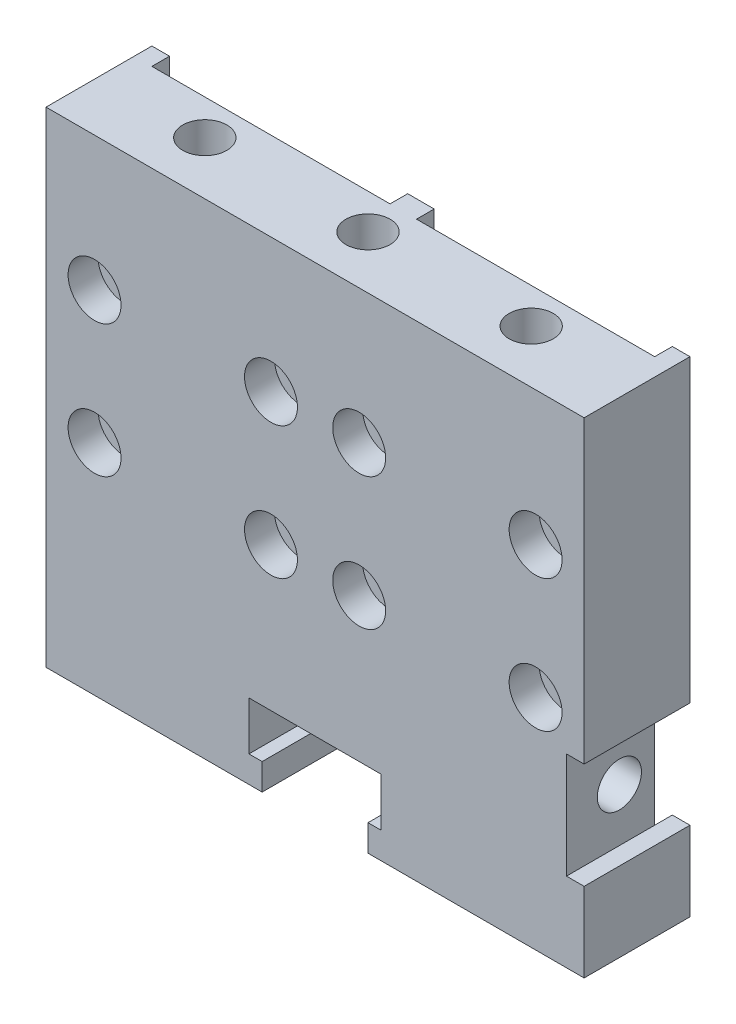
ISO-10303-21;
HEADER;
FILE_DESCRIPTION(('STEP AP214'),'2;1');
FILE_NAME('part.step','',(''),(''),'','','');
FILE_SCHEMA(('AUTOMOTIVE_DESIGN { 1 0 10303 214 1 1 1 1 }'));
ENDSEC;
DATA;
#1=APPLICATION_CONTEXT('core data for automotive mechanical design processes');
#2=APPLICATION_PROTOCOL_DEFINITION('international standard','automotive_design',2000,#1);
#3=PRODUCT_CONTEXT('',#1,'mechanical');
#4=PRODUCT('Part','Part','',(#3));
#5=PRODUCT_RELATED_PRODUCT_CATEGORY('part','',(#4));
#6=PRODUCT_DEFINITION_FORMATION('','',#4);
#7=PRODUCT_DEFINITION_CONTEXT('part definition',#1,'design');
#8=PRODUCT_DEFINITION('design','',#6,#7);
#9=PRODUCT_DEFINITION_SHAPE('','',#8);
#10=(LENGTH_UNIT() NAMED_UNIT(*) SI_UNIT(.MILLI.,.METRE.));
#11=(NAMED_UNIT(*) PLANE_ANGLE_UNIT() SI_UNIT($,.RADIAN.));
#12=(NAMED_UNIT(*) SI_UNIT($,.STERADIAN.) SOLID_ANGLE_UNIT());
#13=UNCERTAINTY_MEASURE_WITH_UNIT(LENGTH_MEASURE(1.E-05),#10,'distance_accuracy_value','');
#14=(GEOMETRIC_REPRESENTATION_CONTEXT(3) GLOBAL_UNCERTAINTY_ASSIGNED_CONTEXT((#13)) GLOBAL_UNIT_ASSIGNED_CONTEXT((#10,
#11,#12)) REPRESENTATION_CONTEXT('',''));
#15=CARTESIAN_POINT('',(0.,0.,0.));
#16=DIRECTION('',(0.,0.,1.));
#17=DIRECTION('',(1.,0.,0.));
#18=AXIS2_PLACEMENT_3D('',#15,#16,#17);
#19=CARTESIAN_POINT('',(0.,0.,0.));
#20=DIRECTION('',(0.,0.,1.));
#21=DIRECTION('',(1.,0.,0.));
#22=AXIS2_PLACEMENT_3D('',#19,#20,#21);
#23=PLANE('',#22);
#24=DIRECTION('',(0.,-1.,0.));
#25=VECTOR('',#24,1.);
#26=CARTESIAN_POINT('',(13.4999999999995,45.,0.));
#27=LINE('',#26,#25);
#28=CARTESIAN_POINT('',(13.4999999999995,-1.,0.));
#29=VERTEX_POINT('',#28);
#30=CARTESIAN_POINT('',(13.4999999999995,-10.,0.));
#31=VERTEX_POINT('',#30);
#32=EDGE_CURVE('E425',#29,#31,#27,.T.);
#33=ORIENTED_EDGE('',*,*,#32,.F.);
#34=DIRECTION('',(1.,0.,0.));
#35=VECTOR('',#34,1.);
#36=CARTESIAN_POINT('',(15.4999999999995,-1.,0.));
#37=LINE('',#36,#35);
#38=CARTESIAN_POINT('',(15.4999999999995,-1.,0.));
#39=VERTEX_POINT('',#38);
#40=EDGE_CURVE('E218',#29,#39,#37,.T.);
#41=ORIENTED_EDGE('',*,*,#40,.T.);
#42=DIRECTION('',(0.,1.,0.));
#43=VECTOR('',#42,1.);
#44=CARTESIAN_POINT('',(15.4999999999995,-10.,0.));
#45=LINE('',#44,#43);
#46=CARTESIAN_POINT('',(15.4999999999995,-10.,0.));
#47=VERTEX_POINT('',#46);
#48=EDGE_CURVE('E449',#47,#39,#45,.T.);
#49=ORIENTED_EDGE('',*,*,#48,.F.);
#50=DIRECTION('',(1.,0.,0.));
#51=VECTOR('',#50,1.);
#52=CARTESIAN_POINT('',(15.4999999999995,-10.,0.));
#53=LINE('',#52,#51);
#54=EDGE_CURVE('E459',#31,#47,#53,.T.);
#55=ORIENTED_EDGE('',*,*,#54,.F.);
#56=EDGE_LOOP('',(#33,#41,#49,#55));
#57=FACE_BOUND('',#56,.T.);
#58=ADVANCED_FACE('F16',(#57),#23,.F.);
#59=CARTESIAN_POINT('',(15.4999999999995,-10.,12.));
#60=DIRECTION('',(-1.,0.,0.));
#61=DIRECTION('',(0.,0.,1.));
#62=AXIS2_PLACEMENT_3D('',#59,#60,#61);
#63=PLANE('',#62);
#64=ORIENTED_EDGE('',*,*,#48,.T.);
#65=DIRECTION('',(0.,0.,1.));
#66=VECTOR('',#65,1.);
#67=CARTESIAN_POINT('',(15.4999999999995,-1.,0.));
#68=LINE('',#67,#66);
#69=CARTESIAN_POINT('',(15.4999999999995,-1.,12.));
#70=VERTEX_POINT('',#69);
#71=EDGE_CURVE('E226',#39,#70,#68,.T.);
#72=ORIENTED_EDGE('',*,*,#71,.T.);
#73=DIRECTION('',(0.,1.,0.));
#74=VECTOR('',#73,1.);
#75=CARTESIAN_POINT('',(15.4999999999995,-10.,12.));
#76=LINE('',#75,#74);
#77=CARTESIAN_POINT('',(15.4999999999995,-10.,12.));
#78=VERTEX_POINT('',#77);
#79=EDGE_CURVE('E436',#78,#70,#76,.T.);
#80=ORIENTED_EDGE('',*,*,#79,.F.);
#81=DIRECTION('',(0.,0.,-1.));
#82=VECTOR('',#81,1.);
#83=CARTESIAN_POINT('',(15.4999999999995,-10.,12.));
#84=LINE('',#83,#82);
#85=EDGE_CURVE('E448',#78,#47,#84,.T.);
#86=ORIENTED_EDGE('',*,*,#85,.T.);
#87=EDGE_LOOP('',(#64,#72,#80,#86));
#88=FACE_BOUND('',#87,.T.);
#89=ADVANCED_FACE('F526',(#88),#63,.F.);
#90=CARTESIAN_POINT('',(13.4999999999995,45.,0.));
#91=DIRECTION('',(1.,0.,0.));
#92=DIRECTION('',(0.,1.,0.));
#93=AXIS2_PLACEMENT_3D('',#90,#91,#92);
#94=PLANE('',#93);
#95=DIRECTION('',(0.,-1.,0.));
#96=VECTOR('',#95,1.);
#97=CARTESIAN_POINT('',(13.4999999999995,45.,2.));
#98=LINE('',#97,#96);
#99=CARTESIAN_POINT('',(13.4999999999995,-1.,2.));
#100=VERTEX_POINT('',#99);
#101=CARTESIAN_POINT('',(13.4999999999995,-10.,2.));
#102=VERTEX_POINT('',#101);
#103=EDGE_CURVE('E416',#100,#102,#98,.T.);
#104=ORIENTED_EDGE('',*,*,#103,.F.);
#105=DIRECTION('',(0.,0.,1.));
#106=VECTOR('',#105,1.);
#107=CARTESIAN_POINT('',(13.4999999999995,-1.,0.));
#108=LINE('',#107,#106);
#109=EDGE_CURVE('E33',#29,#100,#108,.T.);
#110=ORIENTED_EDGE('',*,*,#109,.F.);
#111=ORIENTED_EDGE('',*,*,#32,.T.);
#112=DIRECTION('',(0.,0.,1.));
#113=VECTOR('',#112,1.);
#114=CARTESIAN_POINT('',(13.4999999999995,-10.,0.));
#115=LINE('',#114,#113);
#116=EDGE_CURVE('E397',#31,#102,#115,.T.);
#117=ORIENTED_EDGE('',*,*,#116,.T.);
#118=EDGE_LOOP('',(#104,#110,#111,#117));
#119=FACE_BOUND('',#118,.T.);
#120=ADVANCED_FACE('F535',(#119),#94,.F.);
#121=CARTESIAN_POINT('',(15.4999999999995,-10.,12.));
#122=DIRECTION('',(0.,1.,0.));
#123=DIRECTION('',(-1.,0.,0.));
#124=AXIS2_PLACEMENT_3D('',#121,#122,#123);
#125=PLANE('',#124);
#126=DIRECTION('',(1.,0.,0.));
#127=VECTOR('',#126,1.);
#128=CARTESIAN_POINT('',(15.4999999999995,-10.,12.));
#129=LINE('',#128,#127);
#130=CARTESIAN_POINT('',(-9.00000040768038,-10.,12.));
#131=VERTEX_POINT('',#130);
#132=EDGE_CURVE('E444',#131,#78,#129,.T.);
#133=ORIENTED_EDGE('',*,*,#132,.F.);
#134=DIRECTION('',(0.,0.,1.));
#135=VECTOR('',#134,1.);
#136=CARTESIAN_POINT('',(-9.00000040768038,-10.,0.));
#137=LINE('',#136,#135);
#138=CARTESIAN_POINT('',(-9.00000040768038,-10.,2.));
#139=VERTEX_POINT('',#138);
#140=EDGE_CURVE('E365',#139,#131,#137,.T.);
#141=ORIENTED_EDGE('',*,*,#140,.F.);
#142=DIRECTION('',(-1.,0.,0.));
#143=VECTOR('',#142,1.);
#144=CARTESIAN_POINT('',(13.4999999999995,-10.,2.));
#145=LINE('',#144,#143);
#146=EDGE_CURVE('E410',#102,#139,#145,.T.);
#147=ORIENTED_EDGE('',*,*,#146,.F.);
#148=ORIENTED_EDGE('',*,*,#116,.F.);
#149=ORIENTED_EDGE('',*,*,#54,.T.);
#150=ORIENTED_EDGE('',*,*,#85,.F.);
#151=EDGE_LOOP('',(#133,#141,#147,#148,#149,#150));
#152=FACE_BOUND('',#151,.T.);
#153=ADVANCED_FACE('F542',(#152),#125,.F.);
#154=DIRECTION('',(-1.,0.,0.));
#155=VECTOR('',#154,1.);
#156=CARTESIAN_POINT('',(15.4999999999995,45.,0.));
#157=LINE('',#156,#155);
#158=CARTESIAN_POINT('',(-43.5000008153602,45.,0.));
#159=VERTEX_POINT('',#158);
#160=CARTESIAN_POINT('',(-45.5000008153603,45.,0.));
#161=VERTEX_POINT('',#160);
#162=EDGE_CURVE('E452',#159,#161,#157,.T.);
#163=ORIENTED_EDGE('',*,*,#162,.F.);
#164=DIRECTION('',(0.,-1.,0.));
#165=VECTOR('',#164,1.);
#166=CARTESIAN_POINT('',(-43.5000008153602,45.,0.));
#167=LINE('',#166,#165);
#168=CARTESIAN_POINT('',(-43.5000008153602,-10.,0.));
#169=VERTEX_POINT('',#168);
#170=EDGE_CURVE('E394',#159,#169,#167,.T.);
#171=ORIENTED_EDGE('',*,*,#170,.T.);
#172=CARTESIAN_POINT('',(-45.5000008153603,-10.,0.));
#173=VERTEX_POINT('',#172);
#174=EDGE_CURVE('E460',#173,#169,#53,.T.);
#175=ORIENTED_EDGE('',*,*,#174,.F.);
#176=DIRECTION('',(0.,-1.,0.));
#177=VECTOR('',#176,1.);
#178=CARTESIAN_POINT('',(-45.5000008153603,-10.,0.));
#179=LINE('',#178,#177);
#180=EDGE_CURVE('E456',#161,#173,#179,.T.);
#181=ORIENTED_EDGE('',*,*,#180,.F.);
#182=EDGE_LOOP('',(#163,#171,#175,#181));
#183=FACE_BOUND('',#182,.T.);
#184=ADVANCED_FACE('F529',(#183),#23,.F.);
#185=CARTESIAN_POINT('',(15.4999999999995,11.,0.));
#186=VERTEX_POINT('',#185);
#187=CARTESIAN_POINT('',(15.4999999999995,45.,0.));
#188=VERTEX_POINT('',#187);
#189=EDGE_CURVE('E424',#186,#188,#45,.T.);
#190=ORIENTED_EDGE('',*,*,#189,.F.);
#191=DIRECTION('',(-1.,0.,0.));
#192=VECTOR('',#191,1.);
#193=CARTESIAN_POINT('',(15.4999999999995,11.,0.));
#194=LINE('',#193,#192);
#195=CARTESIAN_POINT('',(13.4999999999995,11.,0.));
#196=VERTEX_POINT('',#195);
#197=EDGE_CURVE('E215',#186,#196,#194,.T.);
#198=ORIENTED_EDGE('',*,*,#197,.T.);
#199=CARTESIAN_POINT('',(13.4999999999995,45.,0.));
#200=VERTEX_POINT('',#199);
#201=EDGE_CURVE('E421',#200,#196,#27,.T.);
#202=ORIENTED_EDGE('',*,*,#201,.F.);
#203=EDGE_CURVE('E453',#188,#200,#157,.T.);
#204=ORIENTED_EDGE('',*,*,#203,.F.);
#205=EDGE_LOOP('',(#190,#198,#202,#204));
#206=FACE_BOUND('',#205,.T.);
#207=ADVANCED_FACE('F541',(#206),#23,.F.);
#208=CARTESIAN_POINT('',(15.4999999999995,11.,12.));
#209=VERTEX_POINT('',#208);
#210=CARTESIAN_POINT('',(15.4999999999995,45.,12.));
#211=VERTEX_POINT('',#210);
#212=EDGE_CURVE('E440',#209,#211,#76,.T.);
#213=ORIENTED_EDGE('',*,*,#212,.F.);
#214=DIRECTION('',(0.,0.,1.));
#215=VECTOR('',#214,1.);
#216=CARTESIAN_POINT('',(15.4999999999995,11.,0.));
#217=LINE('',#216,#215);
#218=EDGE_CURVE('E221',#186,#209,#217,.T.);
#219=ORIENTED_EDGE('',*,*,#218,.F.);
#220=ORIENTED_EDGE('',*,*,#189,.T.);
#221=DIRECTION('',(0.,0.,-1.));
#222=VECTOR('',#221,1.);
#223=CARTESIAN_POINT('',(15.4999999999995,45.,12.));
#224=LINE('',#223,#222);
#225=EDGE_CURVE('E471',#211,#188,#224,.T.);
#226=ORIENTED_EDGE('',*,*,#225,.F.);
#227=EDGE_LOOP('',(#213,#219,#220,#226));
#228=FACE_BOUND('',#227,.T.);
#229=ADVANCED_FACE('F18',(#228),#63,.F.);
#230=CARTESIAN_POINT('',(15.4999999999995,45.,12.));
#231=DIRECTION('',(0.,-1.,0.));
#232=DIRECTION('',(1.,0.,0.));
#233=AXIS2_PLACEMENT_3D('',#230,#231,#232);
#234=PLANE('',#233);
#235=CARTESIAN_POINT('',(-33.5000000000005,45.,6.));
#236=DIRECTION('',(0.,1.,0.));
#237=DIRECTION('',(0.,0.,1.));
#238=AXIS2_PLACEMENT_3D('',#235,#236,#237);
#239=CIRCLE('',#238,2.5);
#240=CARTESIAN_POINT('',(-33.5000000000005,45.,8.5));
#241=VERTEX_POINT('',#240);
#242=EDGE_CURVE('E229',#241,#241,#239,.T.);
#243=ORIENTED_EDGE('',*,*,#242,.F.);
#244=EDGE_LOOP('',(#243));
#245=FACE_BOUND('',#244,.T.);
#246=CARTESIAN_POINT('',(-15.0000000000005,45.,6.));
#247=DIRECTION('',(0.,1.,0.));
#248=DIRECTION('',(0.,0.,1.));
#249=AXIS2_PLACEMENT_3D('',#246,#247,#248);
#250=CIRCLE('',#249,2.5);
#251=CARTESIAN_POINT('',(-15.0000000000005,45.,8.5));
#252=VERTEX_POINT('',#251);
#253=EDGE_CURVE('E242',#252,#252,#250,.T.);
#254=ORIENTED_EDGE('',*,*,#253,.F.);
#255=EDGE_LOOP('',(#254));
#256=FACE_BOUND('',#255,.T.);
#257=CARTESIAN_POINT('',(3.49999999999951,45.,6.));
#258=DIRECTION('',(0.,1.,0.));
#259=DIRECTION('',(0.,0.,1.));
#260=AXIS2_PLACEMENT_3D('',#257,#258,#259);
#261=CIRCLE('',#260,2.5);
#262=CARTESIAN_POINT('',(3.49999999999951,45.,8.5));
#263=VERTEX_POINT('',#262);
#264=EDGE_CURVE('E248',#263,#263,#261,.T.);
#265=ORIENTED_EDGE('',*,*,#264,.F.);
#266=EDGE_LOOP('',(#265));
#267=FACE_BOUND('',#266,.T.);
#268=DIRECTION('',(-1.,0.,0.));
#269=VECTOR('',#268,1.);
#270=CARTESIAN_POINT('',(-43.5000008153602,45.,2.));
#271=LINE('',#270,#269);
#272=CARTESIAN_POINT('',(-16.5000008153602,45.,2.));
#273=VERTEX_POINT('',#272);
#274=CARTESIAN_POINT('',(-43.5000008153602,45.,2.));
#275=VERTEX_POINT('',#274);
#276=EDGE_CURVE('E384',#273,#275,#271,.T.);
#277=ORIENTED_EDGE('',*,*,#276,.T.);
#278=DIRECTION('',(0.,0.,-1.));
#279=VECTOR('',#278,1.);
#280=CARTESIAN_POINT('',(-43.5000008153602,45.,0.));
#281=LINE('',#280,#279);
#282=EDGE_CURVE('E388',#275,#159,#281,.T.);
#283=ORIENTED_EDGE('',*,*,#282,.T.);
#284=ORIENTED_EDGE('',*,*,#162,.T.);
#285=DIRECTION('',(0.,0.,-1.));
#286=VECTOR('',#285,1.);
#287=CARTESIAN_POINT('',(-45.5000008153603,45.,12.));
#288=LINE('',#287,#286);
#289=CARTESIAN_POINT('',(-45.5000008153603,45.,12.));
#290=VERTEX_POINT('',#289);
#291=EDGE_CURVE('E468',#290,#161,#288,.T.);
#292=ORIENTED_EDGE('',*,*,#291,.F.);
#293=DIRECTION('',(-1.,0.,0.));
#294=VECTOR('',#293,1.);
#295=CARTESIAN_POINT('',(15.4999999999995,45.,12.));
#296=LINE('',#295,#294);
#297=EDGE_CURVE('E439',#211,#290,#296,.T.);
#298=ORIENTED_EDGE('',*,*,#297,.F.);
#299=ORIENTED_EDGE('',*,*,#225,.T.);
#300=ORIENTED_EDGE('',*,*,#203,.T.);
#301=DIRECTION('',(0.,0.,1.));
#302=VECTOR('',#301,1.);
#303=CARTESIAN_POINT('',(13.4999999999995,45.,0.));
#304=LINE('',#303,#302);
#305=CARTESIAN_POINT('',(13.4999999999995,45.,2.));
#306=VERTEX_POINT('',#305);
#307=EDGE_CURVE('E406',#200,#306,#304,.T.);
#308=ORIENTED_EDGE('',*,*,#307,.T.);
#309=DIRECTION('',(-1.,0.,0.));
#310=VECTOR('',#309,1.);
#311=CARTESIAN_POINT('',(13.4999999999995,45.,2.));
#312=LINE('',#311,#310);
#313=CARTESIAN_POINT('',(-13.5000000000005,45.,2.));
#314=VERTEX_POINT('',#313);
#315=EDGE_CURVE('E409',#306,#314,#312,.T.);
#316=ORIENTED_EDGE('',*,*,#315,.T.);
#317=DIRECTION('',(0.,0.,-1.));
#318=VECTOR('',#317,1.);
#319=CARTESIAN_POINT('',(-13.5000000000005,45.,0.));
#320=LINE('',#319,#318);
#321=CARTESIAN_POINT('',(-13.5000000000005,45.,0.));
#322=VERTEX_POINT('',#321);
#323=EDGE_CURVE('E413',#314,#322,#320,.T.);
#324=ORIENTED_EDGE('',*,*,#323,.T.);
#325=CARTESIAN_POINT('',(-16.5000008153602,45.,0.));
#326=VERTEX_POINT('',#325);
#327=EDGE_CURVE('E457',#322,#326,#157,.T.);
#328=ORIENTED_EDGE('',*,*,#327,.T.);
#329=DIRECTION('',(0.,0.,1.));
#330=VECTOR('',#329,1.);
#331=CARTESIAN_POINT('',(-16.5000008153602,45.,0.));
#332=LINE('',#331,#330);
#333=EDGE_CURVE('E381',#326,#273,#332,.T.);
#334=ORIENTED_EDGE('',*,*,#333,.T.);
#335=EDGE_LOOP('',(#277,#283,#284,#292,#298,#299,#300,#308,#316,#324,#328,#334));
#336=FACE_BOUND('',#335,.T.);
#337=ADVANCED_FACE('F564',(#245,#256,#267,#336),#234,.F.);
#338=CARTESIAN_POINT('',(-45.5000008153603,-10.,12.));
#339=DIRECTION('',(1.,0.,0.));
#340=DIRECTION('',(0.,0.,-1.));
#341=AXIS2_PLACEMENT_3D('',#338,#339,#340);
#342=PLANE('',#341);
#343=ORIENTED_EDGE('',*,*,#180,.T.);
#344=DIRECTION('',(0.,0.,-1.));
#345=VECTOR('',#344,1.);
#346=CARTESIAN_POINT('',(-45.5000008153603,-10.,12.));
#347=LINE('',#346,#345);
#348=CARTESIAN_POINT('',(-45.5000008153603,-10.,12.));
#349=VERTEX_POINT('',#348);
#350=EDGE_CURVE('E465',#349,#173,#347,.T.);
#351=ORIENTED_EDGE('',*,*,#350,.F.);
#352=DIRECTION('',(0.,-1.,0.));
#353=VECTOR('',#352,1.);
#354=CARTESIAN_POINT('',(-45.5000008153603,-10.,12.));
#355=LINE('',#354,#353);
#356=EDGE_CURVE('E442',#290,#349,#355,.T.);
#357=ORIENTED_EDGE('',*,*,#356,.F.);
#358=ORIENTED_EDGE('',*,*,#291,.T.);
#359=EDGE_LOOP('',(#343,#351,#357,#358));
#360=FACE_BOUND('',#359,.T.);
#361=ADVANCED_FACE('F593',(#360),#342,.F.);
#362=DIRECTION('',(-1.,0.,0.));
#363=VECTOR('',#362,1.);
#364=CARTESIAN_POINT('',(-43.5000008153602,-10.,2.));
#365=LINE('',#364,#363);
#366=CARTESIAN_POINT('',(-21.0000004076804,-10.,2.));
#367=VERTEX_POINT('',#366);
#368=CARTESIAN_POINT('',(-43.5000008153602,-10.,2.));
#369=VERTEX_POINT('',#368);
#370=EDGE_CURVE('E380',#367,#369,#365,.T.);
#371=ORIENTED_EDGE('',*,*,#370,.F.);
#372=DIRECTION('',(0.,0.,1.));
#373=VECTOR('',#372,1.);
#374=CARTESIAN_POINT('',(-21.0000004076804,-10.,0.));
#375=LINE('',#374,#373);
#376=CARTESIAN_POINT('',(-21.0000004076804,-10.,12.));
#377=VERTEX_POINT('',#376);
#378=EDGE_CURVE('E367',#367,#377,#375,.T.);
#379=ORIENTED_EDGE('',*,*,#378,.T.);
#380=EDGE_CURVE('E445',#349,#377,#129,.T.);
#381=ORIENTED_EDGE('',*,*,#380,.F.);
#382=ORIENTED_EDGE('',*,*,#350,.T.);
#383=ORIENTED_EDGE('',*,*,#174,.T.);
#384=DIRECTION('',(0.,0.,-1.));
#385=VECTOR('',#384,1.);
#386=CARTESIAN_POINT('',(-43.5000008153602,-10.,0.));
#387=LINE('',#386,#385);
#388=EDGE_CURVE('E385',#369,#169,#387,.T.);
#389=ORIENTED_EDGE('',*,*,#388,.F.);
#390=EDGE_LOOP('',(#371,#379,#381,#382,#383,#389));
#391=FACE_BOUND('',#390,.T.);
#392=ADVANCED_FACE('F556',(#391),#125,.F.);
#393=CARTESIAN_POINT('',(0.,0.,12.));
#394=DIRECTION('',(0.,0.,1.));
#395=DIRECTION('',(1.,0.,0.));
#396=AXIS2_PLACEMENT_3D('',#393,#394,#395);
#397=PLANE('',#396);
#398=DIRECTION('',(1.,0.,0.));
#399=VECTOR('',#398,1.);
#400=CARTESIAN_POINT('',(15.4999999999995,-1.,12.));
#401=LINE('',#400,#399);
#402=CARTESIAN_POINT('',(13.4999999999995,-1.,12.));
#403=VERTEX_POINT('',#402);
#404=EDGE_CURVE('E219',#403,#70,#401,.T.);
#405=ORIENTED_EDGE('',*,*,#404,.F.);
#406=DIRECTION('',(0.,-1.,0.));
#407=VECTOR('',#406,1.);
#408=CARTESIAN_POINT('',(13.4999999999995,-1.,12.));
#409=LINE('',#408,#407);
#410=CARTESIAN_POINT('',(13.4999999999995,11.,12.));
#411=VERTEX_POINT('',#410);
#412=EDGE_CURVE('E210',#411,#403,#409,.T.);
#413=ORIENTED_EDGE('',*,*,#412,.F.);
#414=DIRECTION('',(-1.,0.,0.));
#415=VECTOR('',#414,1.);
#416=CARTESIAN_POINT('',(15.4999999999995,11.,12.));
#417=LINE('',#416,#415);
#418=EDGE_CURVE('E206',#209,#411,#417,.T.);
#419=ORIENTED_EDGE('',*,*,#418,.F.);
#420=ORIENTED_EDGE('',*,*,#212,.T.);
#421=ORIENTED_EDGE('',*,*,#297,.T.);
#422=ORIENTED_EDGE('',*,*,#356,.T.);
#423=ORIENTED_EDGE('',*,*,#380,.T.);
#424=DIRECTION('',(0.,-1.,0.));
#425=VECTOR('',#424,1.);
#426=CARTESIAN_POINT('',(-21.0000004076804,-7.,12.));
#427=LINE('',#426,#425);
#428=CARTESIAN_POINT('',(-21.0000004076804,-7.,12.));
#429=VERTEX_POINT('',#428);
#430=EDGE_CURVE('E344',#429,#377,#427,.T.);
#431=ORIENTED_EDGE('',*,*,#430,.F.);
#432=DIRECTION('',(1.,0.,0.));
#433=VECTOR('',#432,1.);
#434=CARTESIAN_POINT('',(-22.5000004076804,-7.,12.));
#435=LINE('',#434,#433);
#436=CARTESIAN_POINT('',(-22.5000004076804,-7.,12.));
#437=VERTEX_POINT('',#436);
#438=EDGE_CURVE('E341',#437,#429,#435,.T.);
#439=ORIENTED_EDGE('',*,*,#438,.F.);
#440=DIRECTION('',(0.,-1.,0.));
#441=VECTOR('',#440,1.);
#442=CARTESIAN_POINT('',(-22.5000004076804,-1.5,12.));
#443=LINE('',#442,#441);
#444=CARTESIAN_POINT('',(-22.5000004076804,-1.5,12.));
#445=VERTEX_POINT('',#444);
#446=EDGE_CURVE('E338',#445,#437,#443,.T.);
#447=ORIENTED_EDGE('',*,*,#446,.F.);
#448=DIRECTION('',(-1.,0.,0.));
#449=VECTOR('',#448,1.);
#450=CARTESIAN_POINT('',(-7.50000040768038,-1.5,12.));
#451=LINE('',#450,#449);
#452=CARTESIAN_POINT('',(-7.50000040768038,-1.5,12.));
#453=VERTEX_POINT('',#452);
#454=EDGE_CURVE('E337',#453,#445,#451,.T.);
#455=ORIENTED_EDGE('',*,*,#454,.F.);
#456=DIRECTION('',(0.,1.,0.));
#457=VECTOR('',#456,1.);
#458=CARTESIAN_POINT('',(-7.50000040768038,-1.5,12.));
#459=LINE('',#458,#457);
#460=CARTESIAN_POINT('',(-7.50000040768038,-7.,12.));
#461=VERTEX_POINT('',#460);
#462=EDGE_CURVE('E352',#461,#453,#459,.T.);
#463=ORIENTED_EDGE('',*,*,#462,.F.);
#464=DIRECTION('',(1.,0.,0.));
#465=VECTOR('',#464,1.);
#466=CARTESIAN_POINT('',(-7.50000040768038,-7.,12.));
#467=LINE('',#466,#465);
#468=CARTESIAN_POINT('',(-9.00000040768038,-7.,12.));
#469=VERTEX_POINT('',#468);
#470=EDGE_CURVE('E349',#469,#461,#467,.T.);
#471=ORIENTED_EDGE('',*,*,#470,.F.);
#472=DIRECTION('',(0.,1.,0.));
#473=VECTOR('',#472,1.);
#474=CARTESIAN_POINT('',(-9.00000040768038,-7.,12.));
#475=LINE('',#474,#473);
#476=EDGE_CURVE('E346',#131,#469,#475,.T.);
#477=ORIENTED_EDGE('',*,*,#476,.F.);
#478=ORIENTED_EDGE('',*,*,#132,.T.);
#479=ORIENTED_EDGE('',*,*,#79,.T.);
#480=EDGE_LOOP('',(#405,#413,#419,#420,#421,#422,#423,#431,#439,#447,#455,#463,#471,#477,#478,#479));
#481=FACE_BOUND('',#480,.T.);
#482=CARTESIAN_POINT('',(-10.0000000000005,14.8,12.));
#483=DIRECTION('',(0.,0.,1.));
#484=DIRECTION('',(1.,0.,0.));
#485=AXIS2_PLACEMENT_3D('',#482,#483,#484);
#486=CIRCLE('',#485,3.);
#487=CARTESIAN_POINT('',(-7.0000000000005,14.8,12.));
#488=VERTEX_POINT('',#487);
#489=EDGE_CURVE('E254',#488,#488,#486,.T.);
#490=ORIENTED_EDGE('',*,*,#489,.F.);
#491=EDGE_LOOP('',(#490));
#492=FACE_BOUND('',#491,.T.);
#493=CARTESIAN_POINT('',(9.99999999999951,14.8,12.));
#494=DIRECTION('',(0.,0.,1.));
#495=DIRECTION('',(1.,0.,0.));
#496=AXIS2_PLACEMENT_3D('',#493,#494,#495);
#497=CIRCLE('',#496,3.);
#498=CARTESIAN_POINT('',(12.9999999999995,14.8,12.));
#499=VERTEX_POINT('',#498);
#500=EDGE_CURVE('E263',#499,#499,#497,.T.);
#501=ORIENTED_EDGE('',*,*,#500,.F.);
#502=EDGE_LOOP('',(#501));
#503=FACE_BOUND('',#502,.T.);
#504=CARTESIAN_POINT('',(9.99999999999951,29.8,12.));
#505=DIRECTION('',(0.,0.,1.));
#506=DIRECTION('',(1.,0.,0.));
#507=AXIS2_PLACEMENT_3D('',#504,#505,#506);
#508=CIRCLE('',#507,3.);
#509=CARTESIAN_POINT('',(12.9999999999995,29.8,12.));
#510=VERTEX_POINT('',#509);
#511=EDGE_CURVE('E273',#510,#510,#508,.T.);
#512=ORIENTED_EDGE('',*,*,#511,.F.);
#513=EDGE_LOOP('',(#512));
#514=FACE_BOUND('',#513,.T.);
#515=CARTESIAN_POINT('',(-10.0000000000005,29.8,12.));
#516=DIRECTION('',(0.,0.,1.));
#517=DIRECTION('',(1.,0.,0.));
#518=AXIS2_PLACEMENT_3D('',#515,#516,#517);
#519=CIRCLE('',#518,3.);
#520=CARTESIAN_POINT('',(-7.0000000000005,29.8,12.));
#521=VERTEX_POINT('',#520);
#522=EDGE_CURVE('E283',#521,#521,#519,.T.);
#523=ORIENTED_EDGE('',*,*,#522,.F.);
#524=EDGE_LOOP('',(#523));
#525=FACE_BOUND('',#524,.T.);
#526=CARTESIAN_POINT('',(-20.0000000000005,14.8,12.));
#527=DIRECTION('',(0.,0.,1.));
#528=DIRECTION('',(1.,0.,0.));
#529=AXIS2_PLACEMENT_3D('',#526,#527,#528);
#530=CIRCLE('',#529,3.);
#531=CARTESIAN_POINT('',(-17.0000000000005,14.8,12.));
#532=VERTEX_POINT('',#531);
#533=EDGE_CURVE('E293',#532,#532,#530,.T.);
#534=ORIENTED_EDGE('',*,*,#533,.F.);
#535=EDGE_LOOP('',(#534));
#536=FACE_BOUND('',#535,.T.);
#537=CARTESIAN_POINT('',(-20.0000000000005,29.8,12.));
#538=DIRECTION('',(0.,0.,1.));
#539=DIRECTION('',(1.,0.,0.));
#540=AXIS2_PLACEMENT_3D('',#537,#538,#539);
#541=CIRCLE('',#540,3.);
#542=CARTESIAN_POINT('',(-17.0000000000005,29.8,12.));
#543=VERTEX_POINT('',#542);
#544=EDGE_CURVE('E303',#543,#543,#541,.T.);
#545=ORIENTED_EDGE('',*,*,#544,.F.);
#546=EDGE_LOOP('',(#545));
#547=FACE_BOUND('',#546,.T.);
#548=CARTESIAN_POINT('',(-40.0000000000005,14.8,12.));
#549=DIRECTION('',(0.,0.,1.));
#550=DIRECTION('',(1.,0.,0.));
#551=AXIS2_PLACEMENT_3D('',#548,#549,#550);
#552=CIRCLE('',#551,3.);
#553=CARTESIAN_POINT('',(-37.0000000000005,14.8,12.));
#554=VERTEX_POINT('',#553);
#555=EDGE_CURVE('E313',#554,#554,#552,.T.);
#556=ORIENTED_EDGE('',*,*,#555,.F.);
#557=EDGE_LOOP('',(#556));
#558=FACE_BOUND('',#557,.T.);
#559=CARTESIAN_POINT('',(-40.0000000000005,29.8,12.));
#560=DIRECTION('',(0.,0.,1.));
#561=DIRECTION('',(1.,0.,0.));
#562=AXIS2_PLACEMENT_3D('',#559,#560,#561);
#563=CIRCLE('',#562,3.);
#564=CARTESIAN_POINT('',(-37.0000000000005,29.8,12.));
#565=VERTEX_POINT('',#564);
#566=EDGE_CURVE('E323',#565,#565,#563,.T.);
#567=ORIENTED_EDGE('',*,*,#566,.F.);
#568=EDGE_LOOP('',(#567));
#569=FACE_BOUND('',#568,.T.);
#570=ADVANCED_FACE('F546',(#481,#492,#503,#514,#525,#536,#547,#558,#569),#397,.T.);
#571=DIRECTION('',(0.,-1.,0.));
#572=VECTOR('',#571,1.);
#573=CARTESIAN_POINT('',(-13.5000000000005,45.,0.));
#574=LINE('',#573,#572);
#575=CARTESIAN_POINT('',(-13.5000000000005,-1.5,0.));
#576=VERTEX_POINT('',#575);
#577=EDGE_CURVE('E426',#322,#576,#574,.T.);
#578=ORIENTED_EDGE('',*,*,#577,.T.);
#579=DIRECTION('',(-1.,0.,0.));
#580=VECTOR('',#579,1.);
#581=CARTESIAN_POINT('',(-7.50000040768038,-1.5,0.));
#582=LINE('',#581,#580);
#583=CARTESIAN_POINT('',(-16.5000008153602,-1.5,0.));
#584=VERTEX_POINT('',#583);
#585=EDGE_CURVE('E333',#576,#584,#582,.T.);
#586=ORIENTED_EDGE('',*,*,#585,.T.);
#587=DIRECTION('',(0.,-1.,0.));
#588=VECTOR('',#587,1.);
#589=CARTESIAN_POINT('',(-16.5000008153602,45.,0.));
#590=LINE('',#589,#588);
#591=EDGE_CURVE('E391',#326,#584,#590,.T.);
#592=ORIENTED_EDGE('',*,*,#591,.F.);
#593=ORIENTED_EDGE('',*,*,#327,.F.);
#594=EDGE_LOOP('',(#578,#586,#592,#593));
#595=FACE_BOUND('',#594,.T.);
#596=ADVANCED_FACE('F530',(#595),#23,.F.);
#597=ORIENTED_EDGE('',*,*,#201,.T.);
#598=DIRECTION('',(0.,0.,1.));
#599=VECTOR('',#598,1.);
#600=CARTESIAN_POINT('',(13.4999999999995,11.,0.));
#601=LINE('',#600,#599);
#602=CARTESIAN_POINT('',(13.4999999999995,11.,2.));
#603=VERTEX_POINT('',#602);
#604=EDGE_CURVE('E232',#196,#603,#601,.T.);
#605=ORIENTED_EDGE('',*,*,#604,.T.);
#606=EDGE_CURVE('E432',#306,#603,#98,.T.);
#607=ORIENTED_EDGE('',*,*,#606,.F.);
#608=ORIENTED_EDGE('',*,*,#307,.F.);
#609=EDGE_LOOP('',(#597,#605,#607,#608));
#610=FACE_BOUND('',#609,.T.);
#611=ADVANCED_FACE('F545',(#610),#94,.F.);
#612=CARTESIAN_POINT('',(-13.5000000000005,45.,0.));
#613=DIRECTION('',(-1.,0.,0.));
#614=DIRECTION('',(0.,0.,1.));
#615=AXIS2_PLACEMENT_3D('',#612,#613,#614);
#616=PLANE('',#615);
#617=DIRECTION('',(0.,-1.,0.));
#618=VECTOR('',#617,1.);
#619=CARTESIAN_POINT('',(-13.5000000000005,45.,2.));
#620=LINE('',#619,#618);
#621=CARTESIAN_POINT('',(-13.5000000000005,-1.5,2.));
#622=VERTEX_POINT('',#621);
#623=EDGE_CURVE('E429',#314,#622,#620,.T.);
#624=ORIENTED_EDGE('',*,*,#623,.T.);
#625=DIRECTION('',(0.,0.,-1.));
#626=VECTOR('',#625,1.);
#627=CARTESIAN_POINT('',(-13.5000000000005,-1.5,0.));
#628=LINE('',#627,#626);
#629=EDGE_CURVE('E377',#622,#576,#628,.T.);
#630=ORIENTED_EDGE('',*,*,#629,.T.);
#631=ORIENTED_EDGE('',*,*,#577,.F.);
#632=ORIENTED_EDGE('',*,*,#323,.F.);
#633=EDGE_LOOP('',(#624,#630,#631,#632));
#634=FACE_BOUND('',#633,.T.);
#635=ADVANCED_FACE('F553',(#634),#616,.F.);
#636=CARTESIAN_POINT('',(13.4999999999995,45.,2.));
#637=DIRECTION('',(0.,0.,1.));
#638=DIRECTION('',(1.,0.,0.));
#639=AXIS2_PLACEMENT_3D('',#636,#637,#638);
#640=PLANE('',#639);
#641=CARTESIAN_POINT('',(-10.0000000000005,14.8,2.));
#642=DIRECTION('',(0.,0.,1.));
#643=DIRECTION('',(1.,0.,0.));
#644=AXIS2_PLACEMENT_3D('',#641,#642,#643);
#645=CIRCLE('',#644,1.7);
#646=CARTESIAN_POINT('',(-8.3000000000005,14.8,2.));
#647=VERTEX_POINT('',#646);
#648=EDGE_CURVE('E20',#647,#647,#645,.T.);
#649=ORIENTED_EDGE('',*,*,#648,.T.);
#650=EDGE_LOOP('',(#649));
#651=FACE_BOUND('',#650,.T.);
#652=CARTESIAN_POINT('',(9.99999999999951,14.8,2.));
#653=DIRECTION('',(0.,0.,1.));
#654=DIRECTION('',(1.,0.,0.));
#655=AXIS2_PLACEMENT_3D('',#652,#653,#654);
#656=CIRCLE('',#655,1.7);
#657=CARTESIAN_POINT('',(11.6999999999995,14.8,2.));
#658=VERTEX_POINT('',#657);
#659=EDGE_CURVE('E272',#658,#658,#656,.T.);
#660=ORIENTED_EDGE('',*,*,#659,.T.);
#661=EDGE_LOOP('',(#660));
#662=FACE_BOUND('',#661,.T.);
#663=CARTESIAN_POINT('',(9.99999999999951,29.8,2.));
#664=DIRECTION('',(0.,0.,1.));
#665=DIRECTION('',(1.,0.,0.));
#666=AXIS2_PLACEMENT_3D('',#663,#664,#665);
#667=CIRCLE('',#666,1.7);
#668=CARTESIAN_POINT('',(11.6999999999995,29.8,2.));
#669=VERTEX_POINT('',#668);
#670=EDGE_CURVE('E282',#669,#669,#667,.T.);
#671=ORIENTED_EDGE('',*,*,#670,.T.);
#672=EDGE_LOOP('',(#671));
#673=FACE_BOUND('',#672,.T.);
#674=CARTESIAN_POINT('',(-10.0000000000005,29.8,2.));
#675=DIRECTION('',(0.,0.,1.));
#676=DIRECTION('',(1.,0.,0.));
#677=AXIS2_PLACEMENT_3D('',#674,#675,#676);
#678=CIRCLE('',#677,1.7);
#679=CARTESIAN_POINT('',(-8.3000000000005,29.8,2.));
#680=VERTEX_POINT('',#679);
#681=EDGE_CURVE('E292',#680,#680,#678,.T.);
#682=ORIENTED_EDGE('',*,*,#681,.T.);
#683=EDGE_LOOP('',(#682));
#684=FACE_BOUND('',#683,.T.);
#685=DIRECTION('',(0.,1.,0.));
#686=VECTOR('',#685,1.);
#687=CARTESIAN_POINT('',(-7.50000040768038,45.,2.));
#688=LINE('',#687,#686);
#689=CARTESIAN_POINT('',(-7.50000040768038,-7.,2.));
#690=VERTEX_POINT('',#689);
#691=CARTESIAN_POINT('',(-7.50000040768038,-1.5,2.));
#692=VERTEX_POINT('',#691);
#693=EDGE_CURVE('E11',#690,#692,#688,.T.);
#694=ORIENTED_EDGE('',*,*,#693,.T.);
#695=DIRECTION('',(-1.,0.,0.));
#696=VECTOR('',#695,1.);
#697=CARTESIAN_POINT('',(13.4999999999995,-1.5,2.));
#698=LINE('',#697,#696);
#699=EDGE_CURVE('E374',#692,#622,#698,.T.);
#700=ORIENTED_EDGE('',*,*,#699,.T.);
#701=ORIENTED_EDGE('',*,*,#623,.F.);
#702=ORIENTED_EDGE('',*,*,#315,.F.);
#703=ORIENTED_EDGE('',*,*,#606,.T.);
#704=EDGE_CURVE('E435',#603,#100,#98,.T.);
#705=ORIENTED_EDGE('',*,*,#704,.T.);
#706=ORIENTED_EDGE('',*,*,#103,.T.);
#707=ORIENTED_EDGE('',*,*,#146,.T.);
#708=DIRECTION('',(0.,1.,0.));
#709=VECTOR('',#708,1.);
#710=CARTESIAN_POINT('',(-9.00000040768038,45.,2.));
#711=LINE('',#710,#709);
#712=CARTESIAN_POINT('',(-9.00000040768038,-7.,2.));
#713=VERTEX_POINT('',#712);
#714=EDGE_CURVE('E485',#139,#713,#711,.T.);
#715=ORIENTED_EDGE('',*,*,#714,.T.);
#716=DIRECTION('',(1.,0.,0.));
#717=VECTOR('',#716,1.);
#718=CARTESIAN_POINT('',(13.4999999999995,-7.,2.));
#719=LINE('',#718,#717);
#720=EDGE_CURVE('E25',#713,#690,#719,.T.);
#721=ORIENTED_EDGE('',*,*,#720,.T.);
#722=EDGE_LOOP('',(#694,#700,#701,#702,#703,#705,#706,#707,#715,#721));
#723=FACE_BOUND('',#722,.T.);
#724=ADVANCED_FACE('F504',(#651,#662,#673,#684,#723),#640,.F.);
#725=CARTESIAN_POINT('',(-43.5000008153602,45.,0.));
#726=DIRECTION('',(-1.,0.,0.));
#727=DIRECTION('',(0.,-1.,0.));
#728=AXIS2_PLACEMENT_3D('',#725,#726,#727);
#729=PLANE('',#728);
#730=ORIENTED_EDGE('',*,*,#388,.T.);
#731=ORIENTED_EDGE('',*,*,#170,.F.);
#732=ORIENTED_EDGE('',*,*,#282,.F.);
#733=DIRECTION('',(0.,-1.,0.));
#734=VECTOR('',#733,1.);
#735=CARTESIAN_POINT('',(-43.5000008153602,45.,2.));
#736=LINE('',#735,#734);
#737=EDGE_CURVE('E398',#275,#369,#736,.T.);
#738=ORIENTED_EDGE('',*,*,#737,.T.);
#739=EDGE_LOOP('',(#730,#731,#732,#738));
#740=FACE_BOUND('',#739,.T.);
#741=ADVANCED_FACE('F651',(#740),#729,.F.);
#742=CARTESIAN_POINT('',(-43.5000008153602,45.,2.));
#743=DIRECTION('',(0.,0.,1.));
#744=DIRECTION('',(1.,0.,0.));
#745=AXIS2_PLACEMENT_3D('',#742,#743,#744);
#746=PLANE('',#745);
#747=CARTESIAN_POINT('',(-20.0000000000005,14.8,2.));
#748=DIRECTION('',(0.,0.,1.));
#749=DIRECTION('',(1.,0.,0.));
#750=AXIS2_PLACEMENT_3D('',#747,#748,#749);
#751=CIRCLE('',#750,1.7);
#752=CARTESIAN_POINT('',(-18.3000000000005,14.8,2.));
#753=VERTEX_POINT('',#752);
#754=EDGE_CURVE('E302',#753,#753,#751,.T.);
#755=ORIENTED_EDGE('',*,*,#754,.T.);
#756=EDGE_LOOP('',(#755));
#757=FACE_BOUND('',#756,.T.);
#758=CARTESIAN_POINT('',(-20.0000000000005,29.8,2.));
#759=DIRECTION('',(0.,0.,1.));
#760=DIRECTION('',(1.,0.,0.));
#761=AXIS2_PLACEMENT_3D('',#758,#759,#760);
#762=CIRCLE('',#761,1.7);
#763=CARTESIAN_POINT('',(-18.3000000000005,29.8,2.));
#764=VERTEX_POINT('',#763);
#765=EDGE_CURVE('E312',#764,#764,#762,.T.);
#766=ORIENTED_EDGE('',*,*,#765,.T.);
#767=EDGE_LOOP('',(#766));
#768=FACE_BOUND('',#767,.T.);
#769=CARTESIAN_POINT('',(-40.0000000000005,14.8,2.));
#770=DIRECTION('',(0.,0.,1.));
#771=DIRECTION('',(1.,0.,0.));
#772=AXIS2_PLACEMENT_3D('',#769,#770,#771);
#773=CIRCLE('',#772,1.7);
#774=CARTESIAN_POINT('',(-38.3000000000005,14.8,2.));
#775=VERTEX_POINT('',#774);
#776=EDGE_CURVE('E322',#775,#775,#773,.T.);
#777=ORIENTED_EDGE('',*,*,#776,.T.);
#778=EDGE_LOOP('',(#777));
#779=FACE_BOUND('',#778,.T.);
#780=CARTESIAN_POINT('',(-40.0000000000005,29.8,2.));
#781=DIRECTION('',(0.,0.,1.));
#782=DIRECTION('',(1.,0.,0.));
#783=AXIS2_PLACEMENT_3D('',#780,#781,#782);
#784=CIRCLE('',#783,1.7);
#785=CARTESIAN_POINT('',(-38.3000000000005,29.8,2.));
#786=VERTEX_POINT('',#785);
#787=EDGE_CURVE('E332',#786,#786,#784,.T.);
#788=ORIENTED_EDGE('',*,*,#787,.T.);
#789=EDGE_LOOP('',(#788));
#790=FACE_BOUND('',#789,.T.);
#791=DIRECTION('',(0.,-1.,0.));
#792=VECTOR('',#791,1.);
#793=CARTESIAN_POINT('',(-16.5000008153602,45.,2.));
#794=LINE('',#793,#792);
#795=CARTESIAN_POINT('',(-16.5000008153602,-1.5,2.));
#796=VERTEX_POINT('',#795);
#797=EDGE_CURVE('E401',#273,#796,#794,.T.);
#798=ORIENTED_EDGE('',*,*,#797,.T.);
#799=DIRECTION('',(-1.,0.,0.));
#800=VECTOR('',#799,1.);
#801=CARTESIAN_POINT('',(-43.5000008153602,-1.5,2.));
#802=LINE('',#801,#800);
#803=CARTESIAN_POINT('',(-22.5000004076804,-1.5,2.));
#804=VERTEX_POINT('',#803);
#805=EDGE_CURVE('E41',#796,#804,#802,.T.);
#806=ORIENTED_EDGE('',*,*,#805,.T.);
#807=DIRECTION('',(0.,-1.,0.));
#808=VECTOR('',#807,1.);
#809=CARTESIAN_POINT('',(-22.5000004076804,45.,2.));
#810=LINE('',#809,#808);
#811=CARTESIAN_POINT('',(-22.5000004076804,-7.,2.));
#812=VERTEX_POINT('',#811);
#813=EDGE_CURVE('E482',#804,#812,#810,.T.);
#814=ORIENTED_EDGE('',*,*,#813,.T.);
#815=DIRECTION('',(1.,0.,0.));
#816=VECTOR('',#815,1.);
#817=CARTESIAN_POINT('',(-43.5000008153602,-7.,2.));
#818=LINE('',#817,#816);
#819=CARTESIAN_POINT('',(-21.0000004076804,-7.,2.));
#820=VERTEX_POINT('',#819);
#821=EDGE_CURVE('E476',#812,#820,#818,.T.);
#822=ORIENTED_EDGE('',*,*,#821,.T.);
#823=DIRECTION('',(0.,-1.,0.));
#824=VECTOR('',#823,1.);
#825=CARTESIAN_POINT('',(-21.0000004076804,45.,2.));
#826=LINE('',#825,#824);
#827=EDGE_CURVE('E479',#820,#367,#826,.T.);
#828=ORIENTED_EDGE('',*,*,#827,.T.);
#829=ORIENTED_EDGE('',*,*,#370,.T.);
#830=ORIENTED_EDGE('',*,*,#737,.F.);
#831=ORIENTED_EDGE('',*,*,#276,.F.);
#832=EDGE_LOOP('',(#798,#806,#814,#822,#828,#829,#830,#831));
#833=FACE_BOUND('',#832,.T.);
#834=ADVANCED_FACE('F603',(#757,#768,#779,#790,#833),#746,.F.);
#835=CARTESIAN_POINT('',(-16.5000008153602,45.,0.));
#836=DIRECTION('',(1.,0.,0.));
#837=DIRECTION('',(0.,0.,-1.));
#838=AXIS2_PLACEMENT_3D('',#835,#836,#837);
#839=PLANE('',#838);
#840=ORIENTED_EDGE('',*,*,#591,.T.);
#841=DIRECTION('',(0.,0.,1.));
#842=VECTOR('',#841,1.);
#843=CARTESIAN_POINT('',(-16.5000008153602,-1.5,0.));
#844=LINE('',#843,#842);
#845=EDGE_CURVE('E474',#584,#796,#844,.T.);
#846=ORIENTED_EDGE('',*,*,#845,.T.);
#847=ORIENTED_EDGE('',*,*,#797,.F.);
#848=ORIENTED_EDGE('',*,*,#333,.F.);
#849=EDGE_LOOP('',(#840,#846,#847,#848));
#850=FACE_BOUND('',#849,.T.);
#851=ADVANCED_FACE('F657',(#850),#839,.F.);
#852=CARTESIAN_POINT('',(-7.50000040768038,-1.5,0.));
#853=DIRECTION('',(1.,0.,0.));
#854=DIRECTION('',(0.,0.,-1.));
#855=AXIS2_PLACEMENT_3D('',#852,#853,#854);
#856=PLANE('',#855);
#857=DIRECTION('',(0.,0.,1.));
#858=VECTOR('',#857,1.);
#859=CARTESIAN_POINT('',(-7.50000040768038,-7.,0.));
#860=LINE('',#859,#858);
#861=EDGE_CURVE('E361',#690,#461,#860,.T.);
#862=ORIENTED_EDGE('',*,*,#861,.T.);
#863=ORIENTED_EDGE('',*,*,#462,.T.);
#864=DIRECTION('',(0.,0.,1.));
#865=VECTOR('',#864,1.);
#866=CARTESIAN_POINT('',(-7.50000040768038,-1.5,0.));
#867=LINE('',#866,#865);
#868=EDGE_CURVE('E359',#692,#453,#867,.T.);
#869=ORIENTED_EDGE('',*,*,#868,.F.);
#870=ORIENTED_EDGE('',*,*,#693,.F.);
#871=EDGE_LOOP('',(#862,#863,#869,#870));
#872=FACE_BOUND('',#871,.T.);
#873=ADVANCED_FACE('F617',(#872),#856,.F.);
#874=CARTESIAN_POINT('',(-7.50000040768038,-7.,0.));
#875=DIRECTION('',(0.,-1.,0.));
#876=DIRECTION('',(0.,0.,-1.));
#877=AXIS2_PLACEMENT_3D('',#874,#875,#876);
#878=PLANE('',#877);
#879=DIRECTION('',(0.,0.,1.));
#880=VECTOR('',#879,1.);
#881=CARTESIAN_POINT('',(-9.00000040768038,-7.,0.));
#882=LINE('',#881,#880);
#883=EDGE_CURVE('E363',#713,#469,#882,.T.);
#884=ORIENTED_EDGE('',*,*,#883,.T.);
#885=ORIENTED_EDGE('',*,*,#470,.T.);
#886=ORIENTED_EDGE('',*,*,#861,.F.);
#887=ORIENTED_EDGE('',*,*,#720,.F.);
#888=EDGE_LOOP('',(#884,#885,#886,#887));
#889=FACE_BOUND('',#888,.T.);
#890=ADVANCED_FACE('F620',(#889),#878,.F.);
#891=CARTESIAN_POINT('',(-9.00000040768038,-7.,0.));
#892=DIRECTION('',(1.,0.,0.));
#893=DIRECTION('',(0.,0.,-1.));
#894=AXIS2_PLACEMENT_3D('',#891,#892,#893);
#895=PLANE('',#894);
#896=ORIENTED_EDGE('',*,*,#140,.T.);
#897=ORIENTED_EDGE('',*,*,#476,.T.);
#898=ORIENTED_EDGE('',*,*,#883,.F.);
#899=ORIENTED_EDGE('',*,*,#714,.F.);
#900=EDGE_LOOP('',(#896,#897,#898,#899));
#901=FACE_BOUND('',#900,.T.);
#902=ADVANCED_FACE('F635',(#901),#895,.F.);
#903=CARTESIAN_POINT('',(-22.5000004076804,-1.5,0.));
#904=DIRECTION('',(-1.,0.,0.));
#905=DIRECTION('',(0.,0.,1.));
#906=AXIS2_PLACEMENT_3D('',#903,#904,#905);
#907=PLANE('',#906);
#908=DIRECTION('',(0.,0.,1.));
#909=VECTOR('',#908,1.);
#910=CARTESIAN_POINT('',(-22.5000004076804,-1.5,0.));
#911=LINE('',#910,#909);
#912=EDGE_CURVE('E357',#804,#445,#911,.T.);
#913=ORIENTED_EDGE('',*,*,#912,.T.);
#914=ORIENTED_EDGE('',*,*,#446,.T.);
#915=DIRECTION('',(0.,0.,1.));
#916=VECTOR('',#915,1.);
#917=CARTESIAN_POINT('',(-22.5000004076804,-7.,0.));
#918=LINE('',#917,#916);
#919=EDGE_CURVE('E336',#812,#437,#918,.T.);
#920=ORIENTED_EDGE('',*,*,#919,.F.);
#921=ORIENTED_EDGE('',*,*,#813,.F.);
#922=EDGE_LOOP('',(#913,#914,#920,#921));
#923=FACE_BOUND('',#922,.T.);
#924=ADVANCED_FACE('F608',(#923),#907,.F.);
#925=CARTESIAN_POINT('',(-21.0000004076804,-7.,0.));
#926=DIRECTION('',(-1.,0.,0.));
#927=DIRECTION('',(0.,0.,1.));
#928=AXIS2_PLACEMENT_3D('',#925,#926,#927);
#929=PLANE('',#928);
#930=DIRECTION('',(0.,0.,1.));
#931=VECTOR('',#930,1.);
#932=CARTESIAN_POINT('',(-21.0000004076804,-7.,0.));
#933=LINE('',#932,#931);
#934=EDGE_CURVE('E370',#820,#429,#933,.T.);
#935=ORIENTED_EDGE('',*,*,#934,.T.);
#936=ORIENTED_EDGE('',*,*,#430,.T.);
#937=ORIENTED_EDGE('',*,*,#378,.F.);
#938=ORIENTED_EDGE('',*,*,#827,.F.);
#939=EDGE_LOOP('',(#935,#936,#937,#938));
#940=FACE_BOUND('',#939,.T.);
#941=ADVANCED_FACE('F600',(#940),#929,.F.);
#942=CARTESIAN_POINT('',(-22.5000004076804,-7.,0.));
#943=DIRECTION('',(0.,-1.,0.));
#944=DIRECTION('',(0.,0.,-1.));
#945=AXIS2_PLACEMENT_3D('',#942,#943,#944);
#946=PLANE('',#945);
#947=ORIENTED_EDGE('',*,*,#919,.T.);
#948=ORIENTED_EDGE('',*,*,#438,.T.);
#949=ORIENTED_EDGE('',*,*,#934,.F.);
#950=ORIENTED_EDGE('',*,*,#821,.F.);
#951=EDGE_LOOP('',(#947,#948,#949,#950));
#952=FACE_BOUND('',#951,.T.);
#953=ADVANCED_FACE('F606',(#952),#946,.F.);
#954=CARTESIAN_POINT('',(-7.50000040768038,-1.5,0.));
#955=DIRECTION('',(0.,1.,0.));
#956=DIRECTION('',(0.,0.,1.));
#957=AXIS2_PLACEMENT_3D('',#954,#955,#956);
#958=PLANE('',#957);
#959=ORIENTED_EDGE('',*,*,#699,.F.);
#960=ORIENTED_EDGE('',*,*,#868,.T.);
#961=ORIENTED_EDGE('',*,*,#454,.T.);
#962=ORIENTED_EDGE('',*,*,#912,.F.);
#963=ORIENTED_EDGE('',*,*,#805,.F.);
#964=ORIENTED_EDGE('',*,*,#845,.F.);
#965=ORIENTED_EDGE('',*,*,#585,.F.);
#966=ORIENTED_EDGE('',*,*,#629,.F.);
#967=EDGE_LOOP('',(#959,#960,#961,#962,#963,#964,#965,#966));
#968=FACE_BOUND('',#967,.T.);
#969=ADVANCED_FACE('F614',(#968),#958,.F.);
#970=CARTESIAN_POINT('',(-40.0000000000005,29.8,12.));
#971=DIRECTION('',(0.,0.,1.));
#972=DIRECTION('',(1.,0.,0.));
#973=AXIS2_PLACEMENT_3D('',#970,#971,#972);
#974=CYLINDRICAL_SURFACE('',#973,1.7);
#975=CARTESIAN_POINT('',(-40.0000000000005,29.8,8.6));
#976=DIRECTION('',(0.,0.,1.));
#977=DIRECTION('',(1.,0.,0.));
#978=AXIS2_PLACEMENT_3D('',#975,#976,#977);
#979=CIRCLE('',#978,1.7);
#980=CARTESIAN_POINT('',(-38.3000000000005,29.8,8.6));
#981=VERTEX_POINT('',#980);
#982=EDGE_CURVE('E329',#981,#981,#979,.T.);
#983=ORIENTED_EDGE('',*,*,#982,.T.);
#984=EDGE_LOOP('',(#983));
#985=FACE_BOUND('',#984,.T.);
#986=ORIENTED_EDGE('',*,*,#787,.F.);
#987=EDGE_LOOP('',(#986));
#988=FACE_BOUND('',#987,.T.);
#989=ADVANCED_FACE('F979',(#985,#988),#974,.F.);
#990=CARTESIAN_POINT('',(-38.3000000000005,29.8,8.6));
#991=DIRECTION('',(0.,0.,-1.));
#992=DIRECTION('',(-1.,0.,0.));
#993=AXIS2_PLACEMENT_3D('',#990,#991,#992);
#994=PLANE('',#993);
#995=ORIENTED_EDGE('',*,*,#982,.F.);
#996=EDGE_LOOP('',(#995));
#997=FACE_BOUND('',#996,.T.);
#998=CARTESIAN_POINT('',(-40.0000000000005,29.8,8.6));
#999=DIRECTION('',(0.,0.,1.));
#1000=DIRECTION('',(1.,0.,0.));
#1001=AXIS2_PLACEMENT_3D('',#998,#999,#1000);
#1002=CIRCLE('',#1001,3.);
#1003=CARTESIAN_POINT('',(-37.0000000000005,29.8,8.6));
#1004=VERTEX_POINT('',#1003);
#1005=EDGE_CURVE('E326',#1004,#1004,#1002,.T.);
#1006=ORIENTED_EDGE('',*,*,#1005,.T.);
#1007=EDGE_LOOP('',(#1006));
#1008=FACE_BOUND('',#1007,.T.);
#1009=ADVANCED_FACE('F969',(#997,#1008),#994,.F.);
#1010=CARTESIAN_POINT('',(-40.0000000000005,29.8,12.));
#1011=DIRECTION('',(0.,0.,1.));
#1012=DIRECTION('',(1.,0.,0.));
#1013=AXIS2_PLACEMENT_3D('',#1010,#1011,#1012);
#1014=CYLINDRICAL_SURFACE('',#1013,3.);
#1015=ORIENTED_EDGE('',*,*,#1005,.F.);
#1016=EDGE_LOOP('',(#1015));
#1017=FACE_BOUND('',#1016,.T.);
#1018=ORIENTED_EDGE('',*,*,#566,.T.);
#1019=EDGE_LOOP('',(#1018));
#1020=FACE_BOUND('',#1019,.T.);
#1021=ADVANCED_FACE('F959',(#1017,#1020),#1014,.F.);
#1022=CARTESIAN_POINT('',(-40.0000000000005,14.8,12.));
#1023=DIRECTION('',(0.,0.,1.));
#1024=DIRECTION('',(1.,0.,0.));
#1025=AXIS2_PLACEMENT_3D('',#1022,#1023,#1024);
#1026=CYLINDRICAL_SURFACE('',#1025,1.7);
#1027=CARTESIAN_POINT('',(-40.0000000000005,14.8,8.6));
#1028=DIRECTION('',(0.,0.,1.));
#1029=DIRECTION('',(1.,0.,0.));
#1030=AXIS2_PLACEMENT_3D('',#1027,#1028,#1029);
#1031=CIRCLE('',#1030,1.7);
#1032=CARTESIAN_POINT('',(-38.3000000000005,14.8,8.6));
#1033=VERTEX_POINT('',#1032);
#1034=EDGE_CURVE('E319',#1033,#1033,#1031,.T.);
#1035=ORIENTED_EDGE('',*,*,#1034,.T.);
#1036=EDGE_LOOP('',(#1035));
#1037=FACE_BOUND('',#1036,.T.);
#1038=ORIENTED_EDGE('',*,*,#776,.F.);
#1039=EDGE_LOOP('',(#1038));
#1040=FACE_BOUND('',#1039,.T.);
#1041=ADVANCED_FACE('F949',(#1037,#1040),#1026,.F.);
#1042=CARTESIAN_POINT('',(-38.3000000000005,14.8,8.6));
#1043=DIRECTION('',(0.,0.,-1.));
#1044=DIRECTION('',(-1.,0.,0.));
#1045=AXIS2_PLACEMENT_3D('',#1042,#1043,#1044);
#1046=PLANE('',#1045);
#1047=ORIENTED_EDGE('',*,*,#1034,.F.);
#1048=EDGE_LOOP('',(#1047));
#1049=FACE_BOUND('',#1048,.T.);
#1050=CARTESIAN_POINT('',(-40.0000000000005,14.8,8.6));
#1051=DIRECTION('',(0.,0.,1.));
#1052=DIRECTION('',(1.,0.,0.));
#1053=AXIS2_PLACEMENT_3D('',#1050,#1051,#1052);
#1054=CIRCLE('',#1053,3.);
#1055=CARTESIAN_POINT('',(-37.0000000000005,14.8,8.6));
#1056=VERTEX_POINT('',#1055);
#1057=EDGE_CURVE('E316',#1056,#1056,#1054,.T.);
#1058=ORIENTED_EDGE('',*,*,#1057,.T.);
#1059=EDGE_LOOP('',(#1058));
#1060=FACE_BOUND('',#1059,.T.);
#1061=ADVANCED_FACE('F939',(#1049,#1060),#1046,.F.);
#1062=CARTESIAN_POINT('',(-40.0000000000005,14.8,12.));
#1063=DIRECTION('',(0.,0.,1.));
#1064=DIRECTION('',(1.,0.,0.));
#1065=AXIS2_PLACEMENT_3D('',#1062,#1063,#1064);
#1066=CYLINDRICAL_SURFACE('',#1065,3.);
#1067=ORIENTED_EDGE('',*,*,#1057,.F.);
#1068=EDGE_LOOP('',(#1067));
#1069=FACE_BOUND('',#1068,.T.);
#1070=ORIENTED_EDGE('',*,*,#555,.T.);
#1071=EDGE_LOOP('',(#1070));
#1072=FACE_BOUND('',#1071,.T.);
#1073=ADVANCED_FACE('F929',(#1069,#1072),#1066,.F.);
#1074=CARTESIAN_POINT('',(-20.0000000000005,29.8,12.));
#1075=DIRECTION('',(0.,0.,1.));
#1076=DIRECTION('',(1.,0.,0.));
#1077=AXIS2_PLACEMENT_3D('',#1074,#1075,#1076);
#1078=CYLINDRICAL_SURFACE('',#1077,1.7);
#1079=CARTESIAN_POINT('',(-20.0000000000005,29.8,8.6));
#1080=DIRECTION('',(0.,0.,1.));
#1081=DIRECTION('',(1.,0.,0.));
#1082=AXIS2_PLACEMENT_3D('',#1079,#1080,#1081);
#1083=CIRCLE('',#1082,1.7);
#1084=CARTESIAN_POINT('',(-18.3000000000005,29.8,8.6));
#1085=VERTEX_POINT('',#1084);
#1086=EDGE_CURVE('E309',#1085,#1085,#1083,.T.);
#1087=ORIENTED_EDGE('',*,*,#1086,.T.);
#1088=EDGE_LOOP('',(#1087));
#1089=FACE_BOUND('',#1088,.T.);
#1090=ORIENTED_EDGE('',*,*,#765,.F.);
#1091=EDGE_LOOP('',(#1090));
#1092=FACE_BOUND('',#1091,.T.);
#1093=ADVANCED_FACE('F919',(#1089,#1092),#1078,.F.);
#1094=CARTESIAN_POINT('',(-18.3000000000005,29.8,8.6));
#1095=DIRECTION('',(0.,0.,-1.));
#1096=DIRECTION('',(-1.,0.,0.));
#1097=AXIS2_PLACEMENT_3D('',#1094,#1095,#1096);
#1098=PLANE('',#1097);
#1099=ORIENTED_EDGE('',*,*,#1086,.F.);
#1100=EDGE_LOOP('',(#1099));
#1101=FACE_BOUND('',#1100,.T.);
#1102=CARTESIAN_POINT('',(-20.0000000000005,29.8,8.6));
#1103=DIRECTION('',(0.,0.,1.));
#1104=DIRECTION('',(1.,0.,0.));
#1105=AXIS2_PLACEMENT_3D('',#1102,#1103,#1104);
#1106=CIRCLE('',#1105,3.);
#1107=CARTESIAN_POINT('',(-17.0000000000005,29.8,8.6));
#1108=VERTEX_POINT('',#1107);
#1109=EDGE_CURVE('E306',#1108,#1108,#1106,.T.);
#1110=ORIENTED_EDGE('',*,*,#1109,.T.);
#1111=EDGE_LOOP('',(#1110));
#1112=FACE_BOUND('',#1111,.T.);
#1113=ADVANCED_FACE('F909',(#1101,#1112),#1098,.F.);
#1114=CARTESIAN_POINT('',(-20.0000000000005,29.8,12.));
#1115=DIRECTION('',(0.,0.,1.));
#1116=DIRECTION('',(1.,0.,0.));
#1117=AXIS2_PLACEMENT_3D('',#1114,#1115,#1116);
#1118=CYLINDRICAL_SURFACE('',#1117,3.);
#1119=ORIENTED_EDGE('',*,*,#1109,.F.);
#1120=EDGE_LOOP('',(#1119));
#1121=FACE_BOUND('',#1120,.T.);
#1122=ORIENTED_EDGE('',*,*,#544,.T.);
#1123=EDGE_LOOP('',(#1122));
#1124=FACE_BOUND('',#1123,.T.);
#1125=ADVANCED_FACE('F899',(#1121,#1124),#1118,.F.);
#1126=CARTESIAN_POINT('',(-20.0000000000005,14.8,12.));
#1127=DIRECTION('',(0.,0.,1.));
#1128=DIRECTION('',(1.,0.,0.));
#1129=AXIS2_PLACEMENT_3D('',#1126,#1127,#1128);
#1130=CYLINDRICAL_SURFACE('',#1129,1.7);
#1131=CARTESIAN_POINT('',(-20.0000000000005,14.8,8.6));
#1132=DIRECTION('',(0.,0.,1.));
#1133=DIRECTION('',(1.,0.,0.));
#1134=AXIS2_PLACEMENT_3D('',#1131,#1132,#1133);
#1135=CIRCLE('',#1134,1.7);
#1136=CARTESIAN_POINT('',(-18.3000000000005,14.8,8.6));
#1137=VERTEX_POINT('',#1136);
#1138=EDGE_CURVE('E299',#1137,#1137,#1135,.T.);
#1139=ORIENTED_EDGE('',*,*,#1138,.T.);
#1140=EDGE_LOOP('',(#1139));
#1141=FACE_BOUND('',#1140,.T.);
#1142=ORIENTED_EDGE('',*,*,#754,.F.);
#1143=EDGE_LOOP('',(#1142));
#1144=FACE_BOUND('',#1143,.T.);
#1145=ADVANCED_FACE('F889',(#1141,#1144),#1130,.F.);
#1146=CARTESIAN_POINT('',(-18.3000000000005,14.8,8.6));
#1147=DIRECTION('',(0.,0.,-1.));
#1148=DIRECTION('',(-1.,0.,0.));
#1149=AXIS2_PLACEMENT_3D('',#1146,#1147,#1148);
#1150=PLANE('',#1149);
#1151=ORIENTED_EDGE('',*,*,#1138,.F.);
#1152=EDGE_LOOP('',(#1151));
#1153=FACE_BOUND('',#1152,.T.);
#1154=CARTESIAN_POINT('',(-20.0000000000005,14.8,8.6));
#1155=DIRECTION('',(0.,0.,1.));
#1156=DIRECTION('',(1.,0.,0.));
#1157=AXIS2_PLACEMENT_3D('',#1154,#1155,#1156);
#1158=CIRCLE('',#1157,3.);
#1159=CARTESIAN_POINT('',(-17.0000000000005,14.8,8.6));
#1160=VERTEX_POINT('',#1159);
#1161=EDGE_CURVE('E296',#1160,#1160,#1158,.T.);
#1162=ORIENTED_EDGE('',*,*,#1161,.T.);
#1163=EDGE_LOOP('',(#1162));
#1164=FACE_BOUND('',#1163,.T.);
#1165=ADVANCED_FACE('F879',(#1153,#1164),#1150,.F.);
#1166=CARTESIAN_POINT('',(-20.0000000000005,14.8,12.));
#1167=DIRECTION('',(0.,0.,1.));
#1168=DIRECTION('',(1.,0.,0.));
#1169=AXIS2_PLACEMENT_3D('',#1166,#1167,#1168);
#1170=CYLINDRICAL_SURFACE('',#1169,3.);
#1171=ORIENTED_EDGE('',*,*,#1161,.F.);
#1172=EDGE_LOOP('',(#1171));
#1173=FACE_BOUND('',#1172,.T.);
#1174=ORIENTED_EDGE('',*,*,#533,.T.);
#1175=EDGE_LOOP('',(#1174));
#1176=FACE_BOUND('',#1175,.T.);
#1177=ADVANCED_FACE('F869',(#1173,#1176),#1170,.F.);
#1178=CARTESIAN_POINT('',(-10.0000000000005,29.8,12.));
#1179=DIRECTION('',(0.,0.,1.));
#1180=DIRECTION('',(1.,0.,0.));
#1181=AXIS2_PLACEMENT_3D('',#1178,#1179,#1180);
#1182=CYLINDRICAL_SURFACE('',#1181,1.7);
#1183=CARTESIAN_POINT('',(-10.0000000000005,29.8,8.6));
#1184=DIRECTION('',(0.,0.,1.));
#1185=DIRECTION('',(1.,0.,0.));
#1186=AXIS2_PLACEMENT_3D('',#1183,#1184,#1185);
#1187=CIRCLE('',#1186,1.7);
#1188=CARTESIAN_POINT('',(-8.3000000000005,29.8,8.6));
#1189=VERTEX_POINT('',#1188);
#1190=EDGE_CURVE('E289',#1189,#1189,#1187,.T.);
#1191=ORIENTED_EDGE('',*,*,#1190,.T.);
#1192=EDGE_LOOP('',(#1191));
#1193=FACE_BOUND('',#1192,.T.);
#1194=ORIENTED_EDGE('',*,*,#681,.F.);
#1195=EDGE_LOOP('',(#1194));
#1196=FACE_BOUND('',#1195,.T.);
#1197=ADVANCED_FACE('F859',(#1193,#1196),#1182,.F.);
#1198=CARTESIAN_POINT('',(-8.30000000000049,29.8,8.6));
#1199=DIRECTION('',(0.,0.,-1.));
#1200=DIRECTION('',(-1.,0.,0.));
#1201=AXIS2_PLACEMENT_3D('',#1198,#1199,#1200);
#1202=PLANE('',#1201);
#1203=ORIENTED_EDGE('',*,*,#1190,.F.);
#1204=EDGE_LOOP('',(#1203));
#1205=FACE_BOUND('',#1204,.T.);
#1206=CARTESIAN_POINT('',(-10.0000000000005,29.8,8.6));
#1207=DIRECTION('',(0.,0.,1.));
#1208=DIRECTION('',(1.,0.,0.));
#1209=AXIS2_PLACEMENT_3D('',#1206,#1207,#1208);
#1210=CIRCLE('',#1209,3.);
#1211=CARTESIAN_POINT('',(-7.0000000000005,29.8,8.6));
#1212=VERTEX_POINT('',#1211);
#1213=EDGE_CURVE('E286',#1212,#1212,#1210,.T.);
#1214=ORIENTED_EDGE('',*,*,#1213,.T.);
#1215=EDGE_LOOP('',(#1214));
#1216=FACE_BOUND('',#1215,.T.);
#1217=ADVANCED_FACE('F849',(#1205,#1216),#1202,.F.);
#1218=CARTESIAN_POINT('',(-10.0000000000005,29.8,12.));
#1219=DIRECTION('',(0.,0.,1.));
#1220=DIRECTION('',(1.,0.,0.));
#1221=AXIS2_PLACEMENT_3D('',#1218,#1219,#1220);
#1222=CYLINDRICAL_SURFACE('',#1221,3.);
#1223=ORIENTED_EDGE('',*,*,#1213,.F.);
#1224=EDGE_LOOP('',(#1223));
#1225=FACE_BOUND('',#1224,.T.);
#1226=ORIENTED_EDGE('',*,*,#522,.T.);
#1227=EDGE_LOOP('',(#1226));
#1228=FACE_BOUND('',#1227,.T.);
#1229=ADVANCED_FACE('F839',(#1225,#1228),#1222,.F.);
#1230=CARTESIAN_POINT('',(9.99999999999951,29.8,12.));
#1231=DIRECTION('',(0.,0.,1.));
#1232=DIRECTION('',(1.,0.,0.));
#1233=AXIS2_PLACEMENT_3D('',#1230,#1231,#1232);
#1234=CYLINDRICAL_SURFACE('',#1233,1.7);
#1235=CARTESIAN_POINT('',(9.99999999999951,29.8,8.6));
#1236=DIRECTION('',(0.,0.,1.));
#1237=DIRECTION('',(1.,0.,0.));
#1238=AXIS2_PLACEMENT_3D('',#1235,#1236,#1237);
#1239=CIRCLE('',#1238,1.7);
#1240=CARTESIAN_POINT('',(11.6999999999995,29.8,8.6));
#1241=VERTEX_POINT('',#1240);
#1242=EDGE_CURVE('E279',#1241,#1241,#1239,.T.);
#1243=ORIENTED_EDGE('',*,*,#1242,.T.);
#1244=EDGE_LOOP('',(#1243));
#1245=FACE_BOUND('',#1244,.T.);
#1246=ORIENTED_EDGE('',*,*,#670,.F.);
#1247=EDGE_LOOP('',(#1246));
#1248=FACE_BOUND('',#1247,.T.);
#1249=ADVANCED_FACE('F828',(#1245,#1248),#1234,.F.);
#1250=CARTESIAN_POINT('',(11.6999999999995,29.8,8.6));
#1251=DIRECTION('',(0.,0.,-1.));
#1252=DIRECTION('',(-1.,0.,0.));
#1253=AXIS2_PLACEMENT_3D('',#1250,#1251,#1252);
#1254=PLANE('',#1253);
#1255=ORIENTED_EDGE('',*,*,#1242,.F.);
#1256=EDGE_LOOP('',(#1255));
#1257=FACE_BOUND('',#1256,.T.);
#1258=CARTESIAN_POINT('',(9.99999999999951,29.8,8.6));
#1259=DIRECTION('',(0.,0.,1.));
#1260=DIRECTION('',(1.,0.,0.));
#1261=AXIS2_PLACEMENT_3D('',#1258,#1259,#1260);
#1262=CIRCLE('',#1261,3.);
#1263=CARTESIAN_POINT('',(12.9999999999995,29.8,8.6));
#1264=VERTEX_POINT('',#1263);
#1265=EDGE_CURVE('E276',#1264,#1264,#1262,.T.);
#1266=ORIENTED_EDGE('',*,*,#1265,.T.);
#1267=EDGE_LOOP('',(#1266));
#1268=FACE_BOUND('',#1267,.T.);
#1269=ADVANCED_FACE('F522',(#1257,#1268),#1254,.F.);
#1270=CARTESIAN_POINT('',(9.99999999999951,29.8,12.));
#1271=DIRECTION('',(0.,0.,1.));
#1272=DIRECTION('',(1.,0.,0.));
#1273=AXIS2_PLACEMENT_3D('',#1270,#1271,#1272);
#1274=CYLINDRICAL_SURFACE('',#1273,3.);
#1275=ORIENTED_EDGE('',*,*,#1265,.F.);
#1276=EDGE_LOOP('',(#1275));
#1277=FACE_BOUND('',#1276,.T.);
#1278=ORIENTED_EDGE('',*,*,#511,.T.);
#1279=EDGE_LOOP('',(#1278));
#1280=FACE_BOUND('',#1279,.T.);
#1281=ADVANCED_FACE('F510',(#1277,#1280),#1274,.F.);
#1282=CARTESIAN_POINT('',(9.99999999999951,14.8,12.));
#1283=DIRECTION('',(0.,0.,1.));
#1284=DIRECTION('',(1.,0.,0.));
#1285=AXIS2_PLACEMENT_3D('',#1282,#1283,#1284);
#1286=CYLINDRICAL_SURFACE('',#1285,1.7);
#1287=CARTESIAN_POINT('',(9.99999999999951,14.8,8.6));
#1288=DIRECTION('',(0.,0.,1.));
#1289=DIRECTION('',(1.,0.,0.));
#1290=AXIS2_PLACEMENT_3D('',#1287,#1288,#1289);
#1291=CIRCLE('',#1290,1.7);
#1292=CARTESIAN_POINT('',(11.6999999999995,14.8,8.6));
#1293=VERTEX_POINT('',#1292);
#1294=EDGE_CURVE('E269',#1293,#1293,#1291,.T.);
#1295=ORIENTED_EDGE('',*,*,#1294,.T.);
#1296=EDGE_LOOP('',(#1295));
#1297=FACE_BOUND('',#1296,.T.);
#1298=ORIENTED_EDGE('',*,*,#659,.F.);
#1299=EDGE_LOOP('',(#1298));
#1300=FACE_BOUND('',#1299,.T.);
#1301=ADVANCED_FACE('F507',(#1297,#1300),#1286,.F.);
#1302=CARTESIAN_POINT('',(11.6999999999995,14.8,8.6));
#1303=DIRECTION('',(0.,0.,-1.));
#1304=DIRECTION('',(-1.,0.,0.));
#1305=AXIS2_PLACEMENT_3D('',#1302,#1303,#1304);
#1306=PLANE('',#1305);
#1307=ORIENTED_EDGE('',*,*,#1294,.F.);
#1308=EDGE_LOOP('',(#1307));
#1309=FACE_BOUND('',#1308,.T.);
#1310=CARTESIAN_POINT('',(9.99999999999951,14.8,8.6));
#1311=DIRECTION('',(0.,0.,1.));
#1312=DIRECTION('',(1.,0.,0.));
#1313=AXIS2_PLACEMENT_3D('',#1310,#1311,#1312);
#1314=CIRCLE('',#1313,3.);
#1315=CARTESIAN_POINT('',(12.9999999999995,14.8,8.6));
#1316=VERTEX_POINT('',#1315);
#1317=EDGE_CURVE('E266',#1316,#1316,#1314,.T.);
#1318=ORIENTED_EDGE('',*,*,#1317,.T.);
#1319=EDGE_LOOP('',(#1318));
#1320=FACE_BOUND('',#1319,.T.);
#1321=ADVANCED_FACE('F509',(#1309,#1320),#1306,.F.);
#1322=CARTESIAN_POINT('',(9.99999999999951,14.8,12.));
#1323=DIRECTION('',(0.,0.,1.));
#1324=DIRECTION('',(1.,0.,0.));
#1325=AXIS2_PLACEMENT_3D('',#1322,#1323,#1324);
#1326=CYLINDRICAL_SURFACE('',#1325,3.);
#1327=ORIENTED_EDGE('',*,*,#1317,.F.);
#1328=EDGE_LOOP('',(#1327));
#1329=FACE_BOUND('',#1328,.T.);
#1330=ORIENTED_EDGE('',*,*,#500,.T.);
#1331=EDGE_LOOP('',(#1330));
#1332=FACE_BOUND('',#1331,.T.);
#1333=ADVANCED_FACE('F519',(#1329,#1332),#1326,.F.);
#1334=CARTESIAN_POINT('',(-10.0000000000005,14.8,12.));
#1335=DIRECTION('',(0.,0.,1.));
#1336=DIRECTION('',(1.,0.,0.));
#1337=AXIS2_PLACEMENT_3D('',#1334,#1335,#1336);
#1338=CYLINDRICAL_SURFACE('',#1337,1.7);
#1339=CARTESIAN_POINT('',(-10.0000000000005,14.8,8.6));
#1340=DIRECTION('',(0.,0.,1.));
#1341=DIRECTION('',(1.,0.,0.));
#1342=AXIS2_PLACEMENT_3D('',#1339,#1340,#1341);
#1343=CIRCLE('',#1342,1.7);
#1344=CARTESIAN_POINT('',(-8.3000000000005,14.8,8.6));
#1345=VERTEX_POINT('',#1344);
#1346=EDGE_CURVE('E260',#1345,#1345,#1343,.T.);
#1347=ORIENTED_EDGE('',*,*,#1346,.T.);
#1348=EDGE_LOOP('',(#1347));
#1349=FACE_BOUND('',#1348,.T.);
#1350=ORIENTED_EDGE('',*,*,#648,.F.);
#1351=EDGE_LOOP('',(#1350));
#1352=FACE_BOUND('',#1351,.T.);
#1353=ADVANCED_FACE('F673',(#1349,#1352),#1338,.F.);
#1354=CARTESIAN_POINT('',(-8.30000000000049,14.8,8.6));
#1355=DIRECTION('',(0.,0.,-1.));
#1356=DIRECTION('',(-1.,0.,0.));
#1357=AXIS2_PLACEMENT_3D('',#1354,#1355,#1356);
#1358=PLANE('',#1357);
#1359=ORIENTED_EDGE('',*,*,#1346,.F.);
#1360=EDGE_LOOP('',(#1359));
#1361=FACE_BOUND('',#1360,.T.);
#1362=CARTESIAN_POINT('',(-10.0000000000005,14.8,8.6));
#1363=DIRECTION('',(0.,0.,1.));
#1364=DIRECTION('',(1.,0.,0.));
#1365=AXIS2_PLACEMENT_3D('',#1362,#1363,#1364);
#1366=CIRCLE('',#1365,3.);
#1367=CARTESIAN_POINT('',(-7.0000000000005,14.8,8.6));
#1368=VERTEX_POINT('',#1367);
#1369=EDGE_CURVE('E257',#1368,#1368,#1366,.T.);
#1370=ORIENTED_EDGE('',*,*,#1369,.T.);
#1371=EDGE_LOOP('',(#1370));
#1372=FACE_BOUND('',#1371,.T.);
#1373=ADVANCED_FACE('F675',(#1361,#1372),#1358,.F.);
#1374=CARTESIAN_POINT('',(-10.0000000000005,14.8,12.));
#1375=DIRECTION('',(0.,0.,1.));
#1376=DIRECTION('',(1.,0.,0.));
#1377=AXIS2_PLACEMENT_3D('',#1374,#1375,#1376);
#1378=CYLINDRICAL_SURFACE('',#1377,3.);
#1379=ORIENTED_EDGE('',*,*,#1369,.F.);
#1380=EDGE_LOOP('',(#1379));
#1381=FACE_BOUND('',#1380,.T.);
#1382=ORIENTED_EDGE('',*,*,#489,.T.);
#1383=EDGE_LOOP('',(#1382));
#1384=FACE_BOUND('',#1383,.T.);
#1385=ADVANCED_FACE('F683',(#1381,#1384),#1378,.F.);
#1386=CARTESIAN_POINT('',(3.49999999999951,30.,6.));
#1387=DIRECTION('',(0.,1.,0.));
#1388=DIRECTION('',(0.,0.,1.));
#1389=AXIS2_PLACEMENT_3D('',#1386,#1387,#1388);
#1390=CONICAL_SURFACE('',#1389,2.5,1.02974425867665);
#1391=CARTESIAN_POINT('',(3.49999999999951,28.4978484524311,6.));
#1392=VERTEX_POINT('',#1391);
#1393=VERTEX_LOOP('',#1392);
#1394=FACE_BOUND('',#1393,.T.);
#1395=CARTESIAN_POINT('',(3.49999999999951,30.,6.));
#1396=DIRECTION('',(0.,1.,0.));
#1397=DIRECTION('',(0.,0.,1.));
#1398=AXIS2_PLACEMENT_3D('',#1395,#1396,#1397);
#1399=CIRCLE('',#1398,2.5);
#1400=CARTESIAN_POINT('',(3.49999999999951,30.,8.5));
#1401=VERTEX_POINT('',#1400);
#1402=EDGE_CURVE('E251',#1401,#1401,#1399,.T.);
#1403=ORIENTED_EDGE('',*,*,#1402,.T.);
#1404=EDGE_LOOP('',(#1403));
#1405=FACE_BOUND('',#1404,.T.);
#1406=ADVANCED_FACE('F691',(#1394,#1405),#1390,.F.);
#1407=CARTESIAN_POINT('',(3.49999999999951,45.,6.));
#1408=DIRECTION('',(0.,1.,0.));
#1409=DIRECTION('',(0.,0.,1.));
#1410=AXIS2_PLACEMENT_3D('',#1407,#1408,#1409);
#1411=CYLINDRICAL_SURFACE('',#1410,2.5);
#1412=ORIENTED_EDGE('',*,*,#1402,.F.);
#1413=EDGE_LOOP('',(#1412));
#1414=FACE_BOUND('',#1413,.T.);
#1415=ORIENTED_EDGE('',*,*,#264,.T.);
#1416=EDGE_LOOP('',(#1415));
#1417=FACE_BOUND('',#1416,.T.);
#1418=ADVANCED_FACE('F695',(#1414,#1417),#1411,.F.);
#1419=CARTESIAN_POINT('',(-15.0000000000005,30.,6.));
#1420=DIRECTION('',(0.,1.,0.));
#1421=DIRECTION('',(0.,0.,1.));
#1422=AXIS2_PLACEMENT_3D('',#1419,#1420,#1421);
#1423=CONICAL_SURFACE('',#1422,2.5,1.02974425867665);
#1424=CARTESIAN_POINT('',(-15.0000000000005,28.4978484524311,6.));
#1425=VERTEX_POINT('',#1424);
#1426=VERTEX_LOOP('',#1425);
#1427=FACE_BOUND('',#1426,.T.);
#1428=CARTESIAN_POINT('',(-15.0000000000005,30.,6.));
#1429=DIRECTION('',(0.,1.,0.));
#1430=DIRECTION('',(0.,0.,1.));
#1431=AXIS2_PLACEMENT_3D('',#1428,#1429,#1430);
#1432=CIRCLE('',#1431,2.5);
#1433=CARTESIAN_POINT('',(-15.0000000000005,30.,8.5));
#1434=VERTEX_POINT('',#1433);
#1435=EDGE_CURVE('E245',#1434,#1434,#1432,.T.);
#1436=ORIENTED_EDGE('',*,*,#1435,.T.);
#1437=EDGE_LOOP('',(#1436));
#1438=FACE_BOUND('',#1437,.T.);
#1439=ADVANCED_FACE('F699',(#1427,#1438),#1423,.F.);
#1440=CARTESIAN_POINT('',(-15.0000000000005,45.,6.));
#1441=DIRECTION('',(0.,1.,0.));
#1442=DIRECTION('',(0.,0.,1.));
#1443=AXIS2_PLACEMENT_3D('',#1440,#1441,#1442);
#1444=CYLINDRICAL_SURFACE('',#1443,2.5);
#1445=ORIENTED_EDGE('',*,*,#1435,.F.);
#1446=EDGE_LOOP('',(#1445));
#1447=FACE_BOUND('',#1446,.T.);
#1448=ORIENTED_EDGE('',*,*,#253,.T.);
#1449=EDGE_LOOP('',(#1448));
#1450=FACE_BOUND('',#1449,.T.);
#1451=ADVANCED_FACE('F703',(#1447,#1450),#1444,.F.);
#1452=CARTESIAN_POINT('',(-33.5000000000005,30.,6.));
#1453=DIRECTION('',(0.,1.,0.));
#1454=DIRECTION('',(0.,0.,1.));
#1455=AXIS2_PLACEMENT_3D('',#1452,#1453,#1454);
#1456=CONICAL_SURFACE('',#1455,2.5,1.02974425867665);
#1457=CARTESIAN_POINT('',(-33.5000000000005,28.4978484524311,6.));
#1458=VERTEX_POINT('',#1457);
#1459=VERTEX_LOOP('',#1458);
#1460=FACE_BOUND('',#1459,.T.);
#1461=CARTESIAN_POINT('',(-33.5000000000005,30.,6.));
#1462=DIRECTION('',(0.,1.,0.));
#1463=DIRECTION('',(0.,0.,1.));
#1464=AXIS2_PLACEMENT_3D('',#1461,#1462,#1463);
#1465=CIRCLE('',#1464,2.5);
#1466=CARTESIAN_POINT('',(-33.5000000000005,30.,8.5));
#1467=VERTEX_POINT('',#1466);
#1468=EDGE_CURVE('E239',#1467,#1467,#1465,.T.);
#1469=ORIENTED_EDGE('',*,*,#1468,.T.);
#1470=EDGE_LOOP('',(#1469));
#1471=FACE_BOUND('',#1470,.T.);
#1472=ADVANCED_FACE('F707',(#1460,#1471),#1456,.F.);
#1473=CARTESIAN_POINT('',(-33.5000000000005,45.,6.));
#1474=DIRECTION('',(0.,1.,0.));
#1475=DIRECTION('',(0.,0.,1.));
#1476=AXIS2_PLACEMENT_3D('',#1473,#1474,#1475);
#1477=CYLINDRICAL_SURFACE('',#1476,2.5);
#1478=ORIENTED_EDGE('',*,*,#1468,.F.);
#1479=EDGE_LOOP('',(#1478));
#1480=FACE_BOUND('',#1479,.T.);
#1481=ORIENTED_EDGE('',*,*,#242,.T.);
#1482=EDGE_LOOP('',(#1481));
#1483=FACE_BOUND('',#1482,.T.);
#1484=ADVANCED_FACE('F711',(#1480,#1483),#1477,.F.);
#1485=CARTESIAN_POINT('',(13.4999999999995,-1.,0.));
#1486=DIRECTION('',(-1.,0.,0.));
#1487=DIRECTION('',(0.,0.,1.));
#1488=AXIS2_PLACEMENT_3D('',#1485,#1486,#1487);
#1489=PLANE('',#1488);
#1490=CARTESIAN_POINT('',(13.4999999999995,4.99999999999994,6.));
#1491=DIRECTION('',(1.,0.,0.));
#1492=DIRECTION('',(0.,0.,-1.));
#1493=AXIS2_PLACEMENT_3D('',#1490,#1491,#1492);
#1494=CIRCLE('',#1493,2.5);
#1495=CARTESIAN_POINT('',(13.4999999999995,4.99999999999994,3.5));
#1496=VERTEX_POINT('',#1495);
#1497=EDGE_CURVE('E207',#1496,#1496,#1494,.T.);
#1498=ORIENTED_EDGE('',*,*,#1497,.F.);
#1499=EDGE_LOOP('',(#1498));
#1500=FACE_BOUND('',#1499,.T.);
#1501=EDGE_CURVE('E235',#603,#411,#601,.T.);
#1502=ORIENTED_EDGE('',*,*,#1501,.T.);
#1503=ORIENTED_EDGE('',*,*,#412,.T.);
#1504=EDGE_CURVE('E231',#100,#403,#108,.T.);
#1505=ORIENTED_EDGE('',*,*,#1504,.F.);
#1506=ORIENTED_EDGE('',*,*,#704,.F.);
#1507=EDGE_LOOP('',(#1502,#1503,#1505,#1506));
#1508=FACE_BOUND('',#1507,.T.);
#1509=ADVANCED_FACE('F580',(#1500,#1508),#1489,.F.);
#1510=CARTESIAN_POINT('',(15.4999999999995,-1.,0.));
#1511=DIRECTION('',(0.,-1.,0.));
#1512=DIRECTION('',(0.,0.,-1.));
#1513=AXIS2_PLACEMENT_3D('',#1510,#1511,#1512);
#1514=PLANE('',#1513);
#1515=ORIENTED_EDGE('',*,*,#404,.T.);
#1516=ORIENTED_EDGE('',*,*,#71,.F.);
#1517=ORIENTED_EDGE('',*,*,#40,.F.);
#1518=ORIENTED_EDGE('',*,*,#109,.T.);
#1519=ORIENTED_EDGE('',*,*,#1504,.T.);
#1520=EDGE_LOOP('',(#1515,#1516,#1517,#1518,#1519));
#1521=FACE_BOUND('',#1520,.T.);
#1522=ADVANCED_FACE('F633',(#1521),#1514,.F.);
#1523=CARTESIAN_POINT('',(15.4999999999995,11.,0.));
#1524=DIRECTION('',(0.,1.,0.));
#1525=DIRECTION('',(0.,0.,1.));
#1526=AXIS2_PLACEMENT_3D('',#1523,#1524,#1525);
#1527=PLANE('',#1526);
#1528=ORIENTED_EDGE('',*,*,#418,.T.);
#1529=ORIENTED_EDGE('',*,*,#1501,.F.);
#1530=ORIENTED_EDGE('',*,*,#604,.F.);
#1531=ORIENTED_EDGE('',*,*,#197,.F.);
#1532=ORIENTED_EDGE('',*,*,#218,.T.);
#1533=EDGE_LOOP('',(#1528,#1529,#1530,#1531,#1532));
#1534=FACE_BOUND('',#1533,.T.);
#1535=ADVANCED_FACE('F200',(#1534),#1527,.F.);
#1536=CARTESIAN_POINT('',(-3.50000000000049,4.99999999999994,6.));
#1537=DIRECTION('',(1.,0.,0.));
#1538=DIRECTION('',(0.,0.,-1.));
#1539=AXIS2_PLACEMENT_3D('',#1536,#1537,#1538);
#1540=CONICAL_SURFACE('',#1539,2.5,1.02974425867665);
#1541=CARTESIAN_POINT('',(-5.0021515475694,4.99999999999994,6.));
#1542=VERTEX_POINT('',#1541);
#1543=VERTEX_LOOP('',#1542);
#1544=FACE_BOUND('',#1543,.T.);
#1545=CARTESIAN_POINT('',(-3.50000000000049,4.99999999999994,6.));
#1546=DIRECTION('',(1.,0.,0.));
#1547=DIRECTION('',(0.,0.,-1.));
#1548=AXIS2_PLACEMENT_3D('',#1545,#1546,#1547);
#1549=CIRCLE('',#1548,2.5);
#1550=CARTESIAN_POINT('',(-3.50000000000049,4.99999999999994,3.5));
#1551=VERTEX_POINT('',#1550);
#1552=EDGE_CURVE('E204',#1551,#1551,#1549,.T.);
#1553=ORIENTED_EDGE('',*,*,#1552,.T.);
#1554=EDGE_LOOP('',(#1553));
#1555=FACE_BOUND('',#1554,.T.);
#1556=ADVANCED_FACE('F196',(#1544,#1555),#1540,.F.);
#1557=CARTESIAN_POINT('',(13.4999999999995,4.99999999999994,6.));
#1558=DIRECTION('',(1.,0.,0.));
#1559=DIRECTION('',(0.,0.,-1.));
#1560=AXIS2_PLACEMENT_3D('',#1557,#1558,#1559);
#1561=CYLINDRICAL_SURFACE('',#1560,2.5);
#1562=ORIENTED_EDGE('',*,*,#1552,.F.);
#1563=EDGE_LOOP('',(#1562));
#1564=FACE_BOUND('',#1563,.T.);
#1565=ORIENTED_EDGE('',*,*,#1497,.T.);
#1566=EDGE_LOOP('',(#1565));
#1567=FACE_BOUND('',#1566,.T.);
#1568=ADVANCED_FACE('F199',(#1564,#1567),#1561,.F.);
#1569=CLOSED_SHELL('',(#58,#89,#120,#153,#184,#207,#229,#337,#361,#392,#570,#596,#611,#635,#724,
#741,#834,#851,#873,#890,#902,#924,#941,#953,#969,#989,#1009,#1021,#1041,#1061,#1073,#1093,
#1113,#1125,#1145,#1165,#1177,#1197,#1217,#1229,#1249,#1269,#1281,#1301,#1321,#1333,#1353,#1373,
#1385,#1406,#1418,#1439,#1451,#1472,#1484,#1509,#1522,#1535,#1556,#1568));
#1570=MANIFOLD_SOLID_BREP('B1',#1569);
#1571=ADVANCED_BREP_SHAPE_REPRESENTATION('',(#18,#1570),#14);
#1572=SHAPE_DEFINITION_REPRESENTATION(#9,#1571);
ENDSEC;
END-ISO-10303-21;
